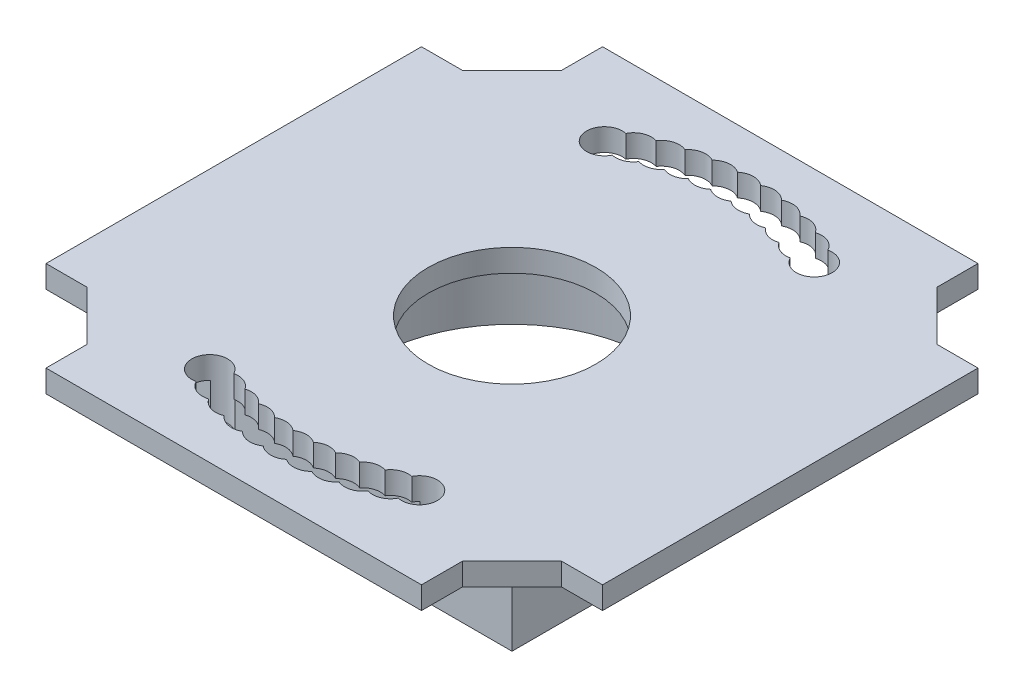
ISO-10303-21;
HEADER;
FILE_DESCRIPTION(('STEP AP214'),'2;1');
FILE_NAME('part.step','',(''),(''),'','','');
FILE_SCHEMA(('AUTOMOTIVE_DESIGN { 1 0 10303 214 1 1 1 1 }'));
ENDSEC;
DATA;
#1=APPLICATION_CONTEXT('core data for automotive mechanical design processes');
#2=APPLICATION_PROTOCOL_DEFINITION('international standard','automotive_design',2000,#1);
#3=PRODUCT_CONTEXT('',#1,'mechanical');
#4=PRODUCT('Part','Part','',(#3));
#5=PRODUCT_RELATED_PRODUCT_CATEGORY('part','',(#4));
#6=PRODUCT_DEFINITION_FORMATION('','',#4);
#7=PRODUCT_DEFINITION_CONTEXT('part definition',#1,'design');
#8=PRODUCT_DEFINITION('design','',#6,#7);
#9=PRODUCT_DEFINITION_SHAPE('','',#8);
#10=(LENGTH_UNIT() NAMED_UNIT(*) SI_UNIT(.MILLI.,.METRE.));
#11=(NAMED_UNIT(*) PLANE_ANGLE_UNIT() SI_UNIT($,.RADIAN.));
#12=(NAMED_UNIT(*) SI_UNIT($,.STERADIAN.) SOLID_ANGLE_UNIT());
#13=UNCERTAINTY_MEASURE_WITH_UNIT(LENGTH_MEASURE(1.E-05),#10,'distance_accuracy_value','');
#14=(GEOMETRIC_REPRESENTATION_CONTEXT(3) GLOBAL_UNCERTAINTY_ASSIGNED_CONTEXT((#13)) GLOBAL_UNIT_ASSIGNED_CONTEXT((#10,
#11,#12)) REPRESENTATION_CONTEXT('',''));
#15=CARTESIAN_POINT('',(0.,0.,0.));
#16=DIRECTION('',(0.,0.,1.));
#17=DIRECTION('',(1.,0.,0.));
#18=AXIS2_PLACEMENT_3D('',#15,#16,#17);
#19=CARTESIAN_POINT('',(0.,0.,0.));
#20=DIRECTION('',(0.,1.,0.));
#21=DIRECTION('',(0.,0.,1.));
#22=AXIS2_PLACEMENT_3D('',#19,#20,#21);
#23=PLANE('',#22);
#24=CARTESIAN_POINT('',(-3.88287979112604,0.,19.6194608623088));
#25=DIRECTION('',(0.,1.,0.));
#26=DIRECTION('',(0.,0.,1.));
#27=AXIS2_PLACEMENT_3D('',#24,#25,#26);
#28=CIRCLE('',#27,1.6);
#29=CARTESIAN_POINT('',(-5.13691253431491,0.,20.613141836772));
#30=VERTEX_POINT('',#29);
#31=CARTESIAN_POINT('',(-3.10187389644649,0.,21.0158955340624));
#32=VERTEX_POINT('',#31);
#33=EDGE_CURVE('E1205',#30,#32,#28,.T.);
#34=ORIENTED_EDGE('',*,*,#33,.F.);
#35=CARTESIAN_POINT('',(-5.77799037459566,0.,19.1471884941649));
#36=DIRECTION('',(0.,1.,0.));
#37=DIRECTION('',(0.,0.,1.));
#38=AXIS2_PLACEMENT_3D('',#35,#36,#37);
#39=CIRCLE('',#38,1.6);
#40=CARTESIAN_POINT('',(-7.12296447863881,0.,20.0138168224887));
#41=VERTEX_POINT('',#40);
#42=EDGE_CURVE('E1209',#41,#30,#39,.T.);
#43=ORIENTED_EDGE('',*,*,#42,.F.);
#44=CARTESIAN_POINT('',(-7.6180008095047,0.,18.4923244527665));
#45=DIRECTION('',(0.,1.,0.));
#46=DIRECTION('',(0.,0.,1.));
#47=AXIS2_PLACEMENT_3D('',#44,#45,#46);
#48=CIRCLE('',#47,1.6);
#49=CARTESIAN_POINT('',(-9.04109031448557,0.,19.2236357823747));
#50=VERTEX_POINT('',#49);
#51=EDGE_CURVE('E1212',#50,#41,#48,.T.);
#52=ORIENTED_EDGE('',*,*,#51,.F.);
#53=CARTESIAN_POINT('',(-9.38536436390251,0.,17.6611136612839));
#54=DIRECTION('',(0.,1.,0.));
#55=DIRECTION('',(0.,0.,1.));
#56=AXIS2_PLACEMENT_3D('',#53,#54,#55);
#57=CIRCLE('',#56,1.6);
#58=CARTESIAN_POINT('',(-7.96227485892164,0.,16.9298023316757));
#59=VERTEX_POINT('',#58);
#60=EDGE_CURVE('E769',#59,#50,#57,.T.);
#61=ORIENTED_EDGE('',*,*,#60,.F.);
#62=CARTESIAN_POINT('',(-7.6180008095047,0.,18.4923244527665));
#63=DIRECTION('',(0.,1.,0.));
#64=DIRECTION('',(0.,0.,1.));
#65=AXIS2_PLACEMENT_3D('',#62,#63,#64);
#66=CIRCLE('',#65,1.6);
#67=CARTESIAN_POINT('',(-6.27302670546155,0.,17.6256961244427));
#68=VERTEX_POINT('',#67);
#69=EDGE_CURVE('E1157',#68,#59,#66,.T.);
#70=ORIENTED_EDGE('',*,*,#69,.F.);
#71=CARTESIAN_POINT('',(-5.77799037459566,0.,19.1471884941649));
#72=DIRECTION('',(0.,1.,0.));
#73=DIRECTION('',(0.,0.,1.));
#74=AXIS2_PLACEMENT_3D('',#71,#72,#73);
#75=CIRCLE('',#74,1.6);
#76=CARTESIAN_POINT('',(-4.52395763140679,0.,18.1535075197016));
#77=VERTEX_POINT('',#76);
#78=EDGE_CURVE('E1207',#77,#68,#75,.T.);
#79=ORIENTED_EDGE('',*,*,#78,.F.);
#80=CARTESIAN_POINT('',(-3.88287979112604,0.,19.6194608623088));
#81=DIRECTION('',(0.,1.,0.));
#82=DIRECTION('',(0.,0.,1.));
#83=AXIS2_PLACEMENT_3D('',#80,#81,#82);
#84=CIRCLE('',#83,1.6);
#85=CARTESIAN_POINT('',(-2.73174713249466,0.,18.5082031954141));
#86=VERTEX_POINT('',#85);
#87=EDGE_CURVE('E1203',#86,#77,#84,.T.);
#88=ORIENTED_EDGE('',*,*,#87,.F.);
#89=CARTESIAN_POINT('',(-1.95074123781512,0.,19.9046378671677));
#90=DIRECTION('',(0.,1.,0.));
#91=DIRECTION('',(0.,0.,1.));
#92=AXIS2_PLACEMENT_3D('',#89,#90,#91);
#93=CIRCLE('',#92,1.6);
#94=CARTESIAN_POINT('',(-0.91348611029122,0.,18.6864006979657));
#95=VERTEX_POINT('',#94);
#96=EDGE_CURVE('E1201',#95,#86,#93,.T.);
#97=ORIENTED_EDGE('',*,*,#96,.F.);
#98=CARTESIAN_POINT('',(0.,0.,20.));
#99=DIRECTION('',(0.,1.,0.));
#100=DIRECTION('',(0.,0.,1.));
#101=AXIS2_PLACEMENT_3D('',#98,#99,#100);
#102=CIRCLE('',#101,1.6);
#103=CARTESIAN_POINT('',(0.913486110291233,0.,18.6864006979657));
#104=VERTEX_POINT('',#103);
#105=EDGE_CURVE('E766',#95,#104,#102,.F.);
#106=ORIENTED_EDGE('',*,*,#105,.T.);
#107=CARTESIAN_POINT('',(1.95074123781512,0.,19.9046378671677));
#108=DIRECTION('',(0.,1.,0.));
#109=DIRECTION('',(0.,0.,1.));
#110=AXIS2_PLACEMENT_3D('',#107,#108,#109);
#111=CIRCLE('',#110,1.6);
#112=CARTESIAN_POINT('',(2.73174713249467,0.,18.5082031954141));
#113=VERTEX_POINT('',#112);
#114=EDGE_CURVE('E763',#113,#104,#111,.T.);
#115=ORIENTED_EDGE('',*,*,#114,.F.);
#116=CARTESIAN_POINT('',(3.88287979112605,0.,19.6194608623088));
#117=DIRECTION('',(0.,1.,0.));
#118=DIRECTION('',(0.,0.,1.));
#119=AXIS2_PLACEMENT_3D('',#116,#117,#118);
#120=CIRCLE('',#119,1.6);
#121=CARTESIAN_POINT('',(4.5239576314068,0.,18.1535075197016));
#122=VERTEX_POINT('',#121);
#123=EDGE_CURVE('E752',#113,#122,#120,.F.);
#124=ORIENTED_EDGE('',*,*,#123,.T.);
#125=CARTESIAN_POINT('',(5.77799037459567,0.,19.1471884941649));
#126=DIRECTION('',(0.,1.,0.));
#127=DIRECTION('',(0.,0.,1.));
#128=AXIS2_PLACEMENT_3D('',#125,#126,#127);
#129=CIRCLE('',#128,1.6);
#130=CARTESIAN_POINT('',(6.27302670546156,0.,17.6256961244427));
#131=VERTEX_POINT('',#130);
#132=EDGE_CURVE('E739',#131,#122,#129,.T.);
#133=ORIENTED_EDGE('',*,*,#132,.F.);
#134=CARTESIAN_POINT('',(7.61800080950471,0.,18.4923244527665));
#135=DIRECTION('',(0.,1.,0.));
#136=DIRECTION('',(0.,0.,1.));
#137=AXIS2_PLACEMENT_3D('',#134,#135,#136);
#138=CIRCLE('',#137,1.6);
#139=CARTESIAN_POINT('',(7.96227485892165,0.,16.9298023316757));
#140=VERTEX_POINT('',#139);
#141=EDGE_CURVE('E1192',#140,#131,#138,.T.);
#142=ORIENTED_EDGE('',*,*,#141,.F.);
#143=CARTESIAN_POINT('',(9.38536436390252,0.,17.6611136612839));
#144=DIRECTION('',(0.,1.,0.));
#145=DIRECTION('',(0.,0.,1.));
#146=AXIS2_PLACEMENT_3D('',#143,#144,#145);
#147=CIRCLE('',#146,1.6);
#148=CARTESIAN_POINT('',(9.04109031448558,0.,19.2236357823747));
#149=VERTEX_POINT('',#148);
#150=EDGE_CURVE('E1197',#149,#140,#147,.T.);
#151=ORIENTED_EDGE('',*,*,#150,.F.);
#152=CARTESIAN_POINT('',(7.61800080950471,0.,18.4923244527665));
#153=DIRECTION('',(0.,1.,0.));
#154=DIRECTION('',(0.,0.,1.));
#155=AXIS2_PLACEMENT_3D('',#152,#153,#154);
#156=CIRCLE('',#155,1.6);
#157=CARTESIAN_POINT('',(7.12296447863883,0.,20.0138168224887));
#158=VERTEX_POINT('',#157);
#159=EDGE_CURVE('E1190',#158,#149,#156,.T.);
#160=ORIENTED_EDGE('',*,*,#159,.F.);
#161=CARTESIAN_POINT('',(5.77799037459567,0.,19.1471884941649));
#162=DIRECTION('',(0.,1.,0.));
#163=DIRECTION('',(0.,0.,1.));
#164=AXIS2_PLACEMENT_3D('',#161,#162,#163);
#165=CIRCLE('',#164,1.6);
#166=CARTESIAN_POINT('',(5.13691253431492,0.,20.613141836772));
#167=VERTEX_POINT('',#166);
#168=EDGE_CURVE('E747',#167,#158,#165,.T.);
#169=ORIENTED_EDGE('',*,*,#168,.F.);
#170=CARTESIAN_POINT('',(3.88287979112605,0.,19.6194608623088));
#171=DIRECTION('',(0.,1.,0.));
#172=DIRECTION('',(0.,0.,1.));
#173=AXIS2_PLACEMENT_3D('',#170,#171,#172);
#174=CIRCLE('',#173,1.6);
#175=CARTESIAN_POINT('',(3.1018738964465,0.,21.0158955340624));
#176=VERTEX_POINT('',#175);
#177=EDGE_CURVE('E764',#167,#176,#174,.F.);
#178=ORIENTED_EDGE('',*,*,#177,.T.);
#179=CARTESIAN_POINT('',(1.95074123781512,0.,19.9046378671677));
#180=DIRECTION('',(0.,1.,0.));
#181=DIRECTION('',(0.,0.,1.));
#182=AXIS2_PLACEMENT_3D('',#179,#180,#181);
#183=CIRCLE('',#182,1.6);
#184=CARTESIAN_POINT('',(1.0372551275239,0.,21.218237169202));
#185=VERTEX_POINT('',#184);
#186=EDGE_CURVE('E777',#185,#176,#183,.T.);
#187=ORIENTED_EDGE('',*,*,#186,.F.);
#188=CARTESIAN_POINT('',(0.,0.,20.));
#189=DIRECTION('',(0.,1.,0.));
#190=DIRECTION('',(0.,0.,1.));
#191=AXIS2_PLACEMENT_3D('',#188,#189,#190);
#192=CIRCLE('',#191,1.6);
#193=CARTESIAN_POINT('',(-1.03725512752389,0.,21.218237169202));
#194=VERTEX_POINT('',#193);
#195=EDGE_CURVE('E774',#185,#194,#192,.F.);
#196=ORIENTED_EDGE('',*,*,#195,.T.);
#197=CARTESIAN_POINT('',(-1.95074123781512,0.,19.9046378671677));
#198=DIRECTION('',(0.,1.,0.));
#199=DIRECTION('',(0.,0.,1.));
#200=AXIS2_PLACEMENT_3D('',#197,#198,#199);
#201=CIRCLE('',#200,1.6);
#202=EDGE_CURVE('E1199',#32,#194,#201,.T.);
#203=ORIENTED_EDGE('',*,*,#202,.F.);
#204=EDGE_LOOP('',(#34,#43,#52,#61,#70,#79,#88,#97,#106,#115,#124,#133,#142,#151,#160,#169,#178,
#187,#196,#203));
#205=FACE_BOUND('',#204,.T.);
#206=DIRECTION('',(0.707106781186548,0.,0.707106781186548));
#207=VECTOR('',#206,1.);
#208=CARTESIAN_POINT('',(-19.0196847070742,0.,19.0196847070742));
#209=LINE('',#208,#207);
#210=CARTESIAN_POINT('',(-21.24,0.,16.7993694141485));
#211=VERTEX_POINT('',#210);
#212=CARTESIAN_POINT('',(-16.7993694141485,0.,21.24));
#213=VERTEX_POINT('',#212);
#214=EDGE_CURVE('E922',#211,#213,#209,.T.);
#215=ORIENTED_EDGE('',*,*,#214,.T.);
#216=DIRECTION('',(0.,0.,1.));
#217=VECTOR('',#216,1.);
#218=CARTESIAN_POINT('',(-16.7993694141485,0.,0.));
#219=LINE('',#218,#217);
#220=CARTESIAN_POINT('',(-16.7993694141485,0.,24.9));
#221=VERTEX_POINT('',#220);
#222=EDGE_CURVE('E925',#213,#221,#219,.T.);
#223=ORIENTED_EDGE('',*,*,#222,.T.);
#224=DIRECTION('',(1.,0.,0.));
#225=VECTOR('',#224,1.);
#226=CARTESIAN_POINT('',(0.,0.,24.9));
#227=LINE('',#226,#225);
#228=CARTESIAN_POINT('',(16.7993694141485,0.,24.9));
#229=VERTEX_POINT('',#228);
#230=EDGE_CURVE('E928',#221,#229,#227,.T.);
#231=ORIENTED_EDGE('',*,*,#230,.T.);
#232=DIRECTION('',(0.,0.,-1.));
#233=VECTOR('',#232,1.);
#234=CARTESIAN_POINT('',(16.7993694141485,0.,0.));
#235=LINE('',#234,#233);
#236=CARTESIAN_POINT('',(16.7993694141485,0.,21.24));
#237=VERTEX_POINT('',#236);
#238=EDGE_CURVE('E931',#229,#237,#235,.T.);
#239=ORIENTED_EDGE('',*,*,#238,.T.);
#240=DIRECTION('',(0.707106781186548,0.,-0.707106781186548));
#241=VECTOR('',#240,1.);
#242=CARTESIAN_POINT('',(19.0196847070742,0.,19.0196847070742));
#243=LINE('',#242,#241);
#244=CARTESIAN_POINT('',(21.24,0.,16.7993694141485));
#245=VERTEX_POINT('',#244);
#246=EDGE_CURVE('E934',#237,#245,#243,.T.);
#247=ORIENTED_EDGE('',*,*,#246,.T.);
#248=DIRECTION('',(1.,0.,0.));
#249=VECTOR('',#248,1.);
#250=CARTESIAN_POINT('',(0.,0.,16.7993694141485));
#251=LINE('',#250,#249);
#252=CARTESIAN_POINT('',(24.9,0.,16.7993694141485));
#253=VERTEX_POINT('',#252);
#254=EDGE_CURVE('E937',#245,#253,#251,.T.);
#255=ORIENTED_EDGE('',*,*,#254,.T.);
#256=DIRECTION('',(0.,0.,-1.));
#257=VECTOR('',#256,1.);
#258=CARTESIAN_POINT('',(24.9,0.,0.));
#259=LINE('',#258,#257);
#260=CARTESIAN_POINT('',(24.9,0.,-16.7993694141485));
#261=VERTEX_POINT('',#260);
#262=EDGE_CURVE('E940',#253,#261,#259,.T.);
#263=ORIENTED_EDGE('',*,*,#262,.T.);
#264=DIRECTION('',(-1.,0.,0.));
#265=VECTOR('',#264,1.);
#266=CARTESIAN_POINT('',(0.,0.,-16.7993694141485));
#267=LINE('',#266,#265);
#268=CARTESIAN_POINT('',(21.24,0.,-16.7993694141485));
#269=VERTEX_POINT('',#268);
#270=EDGE_CURVE('E943',#261,#269,#267,.T.);
#271=ORIENTED_EDGE('',*,*,#270,.T.);
#272=DIRECTION('',(-0.707106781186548,0.,-0.707106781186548));
#273=VECTOR('',#272,1.);
#274=CARTESIAN_POINT('',(19.0196847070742,0.,-19.0196847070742));
#275=LINE('',#274,#273);
#276=CARTESIAN_POINT('',(16.7993694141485,0.,-21.24));
#277=VERTEX_POINT('',#276);
#278=EDGE_CURVE('E946',#269,#277,#275,.T.);
#279=ORIENTED_EDGE('',*,*,#278,.T.);
#280=DIRECTION('',(0.,0.,-1.));
#281=VECTOR('',#280,1.);
#282=CARTESIAN_POINT('',(16.7993694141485,0.,0.));
#283=LINE('',#282,#281);
#284=CARTESIAN_POINT('',(16.7993694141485,0.,-24.9));
#285=VERTEX_POINT('',#284);
#286=EDGE_CURVE('E949',#277,#285,#283,.T.);
#287=ORIENTED_EDGE('',*,*,#286,.T.);
#288=DIRECTION('',(1.,0.,0.));
#289=VECTOR('',#288,1.);
#290=CARTESIAN_POINT('',(0.,0.,-24.9));
#291=LINE('',#290,#289);
#292=CARTESIAN_POINT('',(-16.7993694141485,0.,-24.9));
#293=VERTEX_POINT('',#292);
#294=EDGE_CURVE('E952',#293,#285,#291,.T.);
#295=ORIENTED_EDGE('',*,*,#294,.F.);
#296=DIRECTION('',(0.,0.,1.));
#297=VECTOR('',#296,1.);
#298=CARTESIAN_POINT('',(-16.7993694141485,0.,0.));
#299=LINE('',#298,#297);
#300=CARTESIAN_POINT('',(-16.7993694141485,0.,-21.24));
#301=VERTEX_POINT('',#300);
#302=EDGE_CURVE('E955',#293,#301,#299,.T.);
#303=ORIENTED_EDGE('',*,*,#302,.T.);
#304=DIRECTION('',(-0.707106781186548,0.,0.707106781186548));
#305=VECTOR('',#304,1.);
#306=CARTESIAN_POINT('',(-19.0196847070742,0.,-19.0196847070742));
#307=LINE('',#306,#305);
#308=CARTESIAN_POINT('',(-21.24,0.,-16.7993694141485));
#309=VERTEX_POINT('',#308);
#310=EDGE_CURVE('E958',#301,#309,#307,.T.);
#311=ORIENTED_EDGE('',*,*,#310,.T.);
#312=DIRECTION('',(-1.,0.,0.));
#313=VECTOR('',#312,1.);
#314=CARTESIAN_POINT('',(0.,0.,-16.7993694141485));
#315=LINE('',#314,#313);
#316=CARTESIAN_POINT('',(-24.9,0.,-16.7993694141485));
#317=VERTEX_POINT('',#316);
#318=EDGE_CURVE('E961',#309,#317,#315,.T.);
#319=ORIENTED_EDGE('',*,*,#318,.T.);
#320=DIRECTION('',(0.,0.,-1.));
#321=VECTOR('',#320,1.);
#322=CARTESIAN_POINT('',(-24.9,0.,0.));
#323=LINE('',#322,#321);
#324=CARTESIAN_POINT('',(-24.9,0.,16.7993694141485));
#325=VERTEX_POINT('',#324);
#326=EDGE_CURVE('E964',#325,#317,#323,.T.);
#327=ORIENTED_EDGE('',*,*,#326,.F.);
#328=DIRECTION('',(1.,0.,0.));
#329=VECTOR('',#328,1.);
#330=CARTESIAN_POINT('',(0.,0.,16.7993694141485));
#331=LINE('',#330,#329);
#332=EDGE_CURVE('E967',#325,#211,#331,.T.);
#333=ORIENTED_EDGE('',*,*,#332,.T.);
#334=EDGE_LOOP('',(#215,#223,#231,#239,#247,#255,#263,#271,#279,#287,#295,#303,#311,#319,#327,#333));
#335=FACE_BOUND('',#334,.T.);
#336=CARTESIAN_POINT('',(0.,0.,0.));
#337=DIRECTION('',(0.,1.,0.));
#338=DIRECTION('',(0.,0.,1.));
#339=AXIS2_PLACEMENT_3D('',#336,#337,#338);
#340=CIRCLE('',#339,7.5);
#341=CARTESIAN_POINT('',(0.,0.,7.50000000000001));
#342=VERTEX_POINT('',#341);
#343=EDGE_CURVE('E970',#342,#342,#340,.T.);
#344=ORIENTED_EDGE('',*,*,#343,.F.);
#345=EDGE_LOOP('',(#344));
#346=FACE_BOUND('',#345,.T.);
#347=CARTESIAN_POINT('',(-9.38536436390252,0.,-17.6611136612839));
#348=DIRECTION('',(0.,1.,0.));
#349=DIRECTION('',(0.,0.,1.));
#350=AXIS2_PLACEMENT_3D('',#347,#348,#349);
#351=CIRCLE('',#350,1.6);
#352=CARTESIAN_POINT('',(-9.04109031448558,0.,-19.2236357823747));
#353=VERTEX_POINT('',#352);
#354=CARTESIAN_POINT('',(-7.96227485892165,0.,-16.9298023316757));
#355=VERTEX_POINT('',#354);
#356=EDGE_CURVE('E840',#353,#355,#351,.T.);
#357=ORIENTED_EDGE('',*,*,#356,.F.);
#358=CARTESIAN_POINT('',(-7.61800080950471,0.,-18.4923244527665));
#359=DIRECTION('',(0.,1.,0.));
#360=DIRECTION('',(0.,0.,1.));
#361=AXIS2_PLACEMENT_3D('',#358,#359,#360);
#362=CIRCLE('',#361,1.6);
#363=CARTESIAN_POINT('',(-7.12296447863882,0.,-20.0138168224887));
#364=VERTEX_POINT('',#363);
#365=EDGE_CURVE('E833',#353,#364,#362,.F.);
#366=ORIENTED_EDGE('',*,*,#365,.T.);
#367=CARTESIAN_POINT('',(-5.77799037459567,0.,-19.1471884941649));
#368=DIRECTION('',(0.,1.,0.));
#369=DIRECTION('',(0.,0.,1.));
#370=AXIS2_PLACEMENT_3D('',#367,#368,#369);
#371=CIRCLE('',#370,1.6);
#372=CARTESIAN_POINT('',(-5.13691253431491,0.,-20.613141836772));
#373=VERTEX_POINT('',#372);
#374=EDGE_CURVE('E827',#364,#373,#371,.F.);
#375=ORIENTED_EDGE('',*,*,#374,.T.);
#376=CARTESIAN_POINT('',(-3.88287979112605,0.,-19.6194608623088));
#377=DIRECTION('',(0.,1.,0.));
#378=DIRECTION('',(0.,0.,1.));
#379=AXIS2_PLACEMENT_3D('',#376,#377,#378);
#380=CIRCLE('',#379,1.6);
#381=CARTESIAN_POINT('',(-3.1018738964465,0.,-21.0158955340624));
#382=VERTEX_POINT('',#381);
#383=EDGE_CURVE('E821',#373,#382,#380,.F.);
#384=ORIENTED_EDGE('',*,*,#383,.T.);
#385=CARTESIAN_POINT('',(-1.95074123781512,0.,-19.9046378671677));
#386=DIRECTION('',(0.,1.,0.));
#387=DIRECTION('',(0.,0.,1.));
#388=AXIS2_PLACEMENT_3D('',#385,#386,#387);
#389=CIRCLE('',#388,1.6);
#390=CARTESIAN_POINT('',(-1.0372551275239,0.,-21.218237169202));
#391=VERTEX_POINT('',#390);
#392=EDGE_CURVE('E815',#382,#391,#389,.F.);
#393=ORIENTED_EDGE('',*,*,#392,.T.);
#394=CARTESIAN_POINT('',(0.,0.,-20.));
#395=DIRECTION('',(0.,1.,0.));
#396=DIRECTION('',(0.,0.,1.));
#397=AXIS2_PLACEMENT_3D('',#394,#395,#396);
#398=CIRCLE('',#397,1.6);
#399=CARTESIAN_POINT('',(1.0372551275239,0.,-21.218237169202));
#400=VERTEX_POINT('',#399);
#401=EDGE_CURVE('E809',#391,#400,#398,.F.);
#402=ORIENTED_EDGE('',*,*,#401,.T.);
#403=CARTESIAN_POINT('',(1.95074123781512,0.,-19.9046378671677));
#404=DIRECTION('',(0.,1.,0.));
#405=DIRECTION('',(0.,0.,1.));
#406=AXIS2_PLACEMENT_3D('',#403,#404,#405);
#407=CIRCLE('',#406,1.6);
#408=CARTESIAN_POINT('',(3.1018738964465,0.,-21.0158955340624));
#409=VERTEX_POINT('',#408);
#410=EDGE_CURVE('E803',#400,#409,#407,.F.);
#411=ORIENTED_EDGE('',*,*,#410,.T.);
#412=CARTESIAN_POINT('',(3.88287979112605,0.,-19.6194608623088));
#413=DIRECTION('',(0.,1.,0.));
#414=DIRECTION('',(0.,0.,1.));
#415=AXIS2_PLACEMENT_3D('',#412,#413,#414);
#416=CIRCLE('',#415,1.6);
#417=CARTESIAN_POINT('',(5.13691253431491,0.,-20.613141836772));
#418=VERTEX_POINT('',#417);
#419=EDGE_CURVE('E794',#409,#418,#416,.F.);
#420=ORIENTED_EDGE('',*,*,#419,.T.);
#421=CARTESIAN_POINT('',(5.77799037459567,0.,-19.1471884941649));
#422=DIRECTION('',(0.,1.,0.));
#423=DIRECTION('',(0.,0.,1.));
#424=AXIS2_PLACEMENT_3D('',#421,#422,#423);
#425=CIRCLE('',#424,1.6);
#426=CARTESIAN_POINT('',(7.12296447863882,0.,-20.0138168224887));
#427=VERTEX_POINT('',#426);
#428=EDGE_CURVE('E842',#418,#427,#425,.F.);
#429=ORIENTED_EDGE('',*,*,#428,.T.);
#430=CARTESIAN_POINT('',(7.61800080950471,0.,-18.4923244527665));
#431=DIRECTION('',(0.,1.,0.));
#432=DIRECTION('',(0.,0.,1.));
#433=AXIS2_PLACEMENT_3D('',#430,#431,#432);
#434=CIRCLE('',#433,1.6);
#435=CARTESIAN_POINT('',(9.04109031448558,0.,-19.2236357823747));
#436=VERTEX_POINT('',#435);
#437=EDGE_CURVE('E782',#427,#436,#434,.F.);
#438=ORIENTED_EDGE('',*,*,#437,.T.);
#439=CARTESIAN_POINT('',(9.38536436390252,0.,-17.6611136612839));
#440=DIRECTION('',(0.,1.,0.));
#441=DIRECTION('',(0.,0.,1.));
#442=AXIS2_PLACEMENT_3D('',#439,#440,#441);
#443=CIRCLE('',#442,1.6);
#444=CARTESIAN_POINT('',(7.96227485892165,0.,-16.9298023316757));
#445=VERTEX_POINT('',#444);
#446=EDGE_CURVE('E791',#436,#445,#443,.F.);
#447=ORIENTED_EDGE('',*,*,#446,.T.);
#448=CARTESIAN_POINT('',(7.61800080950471,0.,-18.4923244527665));
#449=DIRECTION('',(0.,1.,0.));
#450=DIRECTION('',(0.,0.,1.));
#451=AXIS2_PLACEMENT_3D('',#448,#449,#450);
#452=CIRCLE('',#451,1.6);
#453=CARTESIAN_POINT('',(6.27302670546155,0.,-17.6256961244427));
#454=VERTEX_POINT('',#453);
#455=EDGE_CURVE('E779',#445,#454,#452,.F.);
#456=ORIENTED_EDGE('',*,*,#455,.T.);
#457=CARTESIAN_POINT('',(5.77799037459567,0.,-19.1471884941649));
#458=DIRECTION('',(0.,1.,0.));
#459=DIRECTION('',(0.,0.,1.));
#460=AXIS2_PLACEMENT_3D('',#457,#458,#459);
#461=CIRCLE('',#460,1.6);
#462=CARTESIAN_POINT('',(4.5239576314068,0.,-18.1535075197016));
#463=VERTEX_POINT('',#462);
#464=EDGE_CURVE('E845',#454,#463,#461,.F.);
#465=ORIENTED_EDGE('',*,*,#464,.T.);
#466=CARTESIAN_POINT('',(3.88287979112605,0.,-19.6194608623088));
#467=DIRECTION('',(0.,1.,0.));
#468=DIRECTION('',(0.,0.,1.));
#469=AXIS2_PLACEMENT_3D('',#466,#467,#468);
#470=CIRCLE('',#469,1.6);
#471=CARTESIAN_POINT('',(2.73174713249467,0.,-18.5082031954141));
#472=VERTEX_POINT('',#471);
#473=EDGE_CURVE('E797',#463,#472,#470,.F.);
#474=ORIENTED_EDGE('',*,*,#473,.T.);
#475=CARTESIAN_POINT('',(1.95074123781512,0.,-19.9046378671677));
#476=DIRECTION('',(0.,1.,0.));
#477=DIRECTION('',(0.,0.,1.));
#478=AXIS2_PLACEMENT_3D('',#475,#476,#477);
#479=CIRCLE('',#478,1.6);
#480=CARTESIAN_POINT('',(0.913486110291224,0.,-18.6864006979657));
#481=VERTEX_POINT('',#480);
#482=EDGE_CURVE('E800',#472,#481,#479,.F.);
#483=ORIENTED_EDGE('',*,*,#482,.T.);
#484=CARTESIAN_POINT('',(0.,0.,-20.));
#485=DIRECTION('',(0.,1.,0.));
#486=DIRECTION('',(0.,0.,1.));
#487=AXIS2_PLACEMENT_3D('',#484,#485,#486);
#488=CIRCLE('',#487,1.6);
#489=CARTESIAN_POINT('',(-0.913486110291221,0.,-18.6864006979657));
#490=VERTEX_POINT('',#489);
#491=EDGE_CURVE('E806',#481,#490,#488,.F.);
#492=ORIENTED_EDGE('',*,*,#491,.T.);
#493=CARTESIAN_POINT('',(-1.95074123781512,0.,-19.9046378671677));
#494=DIRECTION('',(0.,1.,0.));
#495=DIRECTION('',(0.,0.,1.));
#496=AXIS2_PLACEMENT_3D('',#493,#494,#495);
#497=CIRCLE('',#496,1.6);
#498=CARTESIAN_POINT('',(-2.73174713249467,0.,-18.5082031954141));
#499=VERTEX_POINT('',#498);
#500=EDGE_CURVE('E812',#490,#499,#497,.F.);
#501=ORIENTED_EDGE('',*,*,#500,.T.);
#502=CARTESIAN_POINT('',(-3.88287979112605,0.,-19.6194608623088));
#503=DIRECTION('',(0.,1.,0.));
#504=DIRECTION('',(0.,0.,1.));
#505=AXIS2_PLACEMENT_3D('',#502,#503,#504);
#506=CIRCLE('',#505,1.6);
#507=CARTESIAN_POINT('',(-4.5239576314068,0.,-18.1535075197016));
#508=VERTEX_POINT('',#507);
#509=EDGE_CURVE('E818',#499,#508,#506,.F.);
#510=ORIENTED_EDGE('',*,*,#509,.T.);
#511=CARTESIAN_POINT('',(-5.77799037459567,0.,-19.1471884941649));
#512=DIRECTION('',(0.,1.,0.));
#513=DIRECTION('',(0.,0.,1.));
#514=AXIS2_PLACEMENT_3D('',#511,#512,#513);
#515=CIRCLE('',#514,1.6);
#516=CARTESIAN_POINT('',(-6.27302670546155,0.,-17.6256961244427));
#517=VERTEX_POINT('',#516);
#518=EDGE_CURVE('E824',#508,#517,#515,.F.);
#519=ORIENTED_EDGE('',*,*,#518,.T.);
#520=CARTESIAN_POINT('',(-7.61800080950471,0.,-18.4923244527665));
#521=DIRECTION('',(0.,1.,0.));
#522=DIRECTION('',(0.,0.,1.));
#523=AXIS2_PLACEMENT_3D('',#520,#521,#522);
#524=CIRCLE('',#523,1.6);
#525=EDGE_CURVE('E830',#517,#355,#524,.F.);
#526=ORIENTED_EDGE('',*,*,#525,.T.);
#527=EDGE_LOOP('',(#357,#366,#375,#384,#393,#402,#411,#420,#429,#438,#447,#456,#465,#474,#483,
#492,#501,#510,#519,#526));
#528=FACE_BOUND('',#527,.T.);
#529=ADVANCED_FACE('F316',(#205,#335,#346,#528),#23,.T.);
#530=CARTESIAN_POINT('',(-16.5,70.4278354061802,-16.5));
#531=DIRECTION('',(0.,0.,-1.));
#532=DIRECTION('',(-1.,0.,0.));
#533=AXIS2_PLACEMENT_3D('',#530,#531,#532);
#534=PLANE('',#533);
#535=DIRECTION('',(0.,-1.,0.));
#536=VECTOR('',#535,1.);
#537=CARTESIAN_POINT('',(-8.284539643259,1.2E-05,-16.5));
#538=LINE('',#537,#536);
#539=CARTESIAN_POINT('',(-8.284539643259,-2.,-16.5));
#540=VERTEX_POINT('',#539);
#541=CARTESIAN_POINT('',(-8.284539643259,-5.,-16.5));
#542=VERTEX_POINT('',#541);
#543=EDGE_CURVE('E836',#540,#542,#538,.T.);
#544=ORIENTED_EDGE('',*,*,#543,.F.);
#545=DIRECTION('',(1.,0.,0.));
#546=VECTOR('',#545,1.);
#547=CARTESIAN_POINT('',(-16.5,-2.,-16.5));
#548=LINE('',#547,#546);
#549=CARTESIAN_POINT('',(8.284539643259,-2.,-16.5));
#550=VERTEX_POINT('',#549);
#551=EDGE_CURVE('E882',#540,#550,#548,.T.);
#552=ORIENTED_EDGE('',*,*,#551,.T.);
#553=DIRECTION('',(0.,-1.,0.));
#554=VECTOR('',#553,1.);
#555=CARTESIAN_POINT('',(8.284539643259,1.2E-05,-16.5));
#556=LINE('',#555,#554);
#557=CARTESIAN_POINT('',(8.284539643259,-5.,-16.5));
#558=VERTEX_POINT('',#557);
#559=EDGE_CURVE('E785',#550,#558,#556,.T.);
#560=ORIENTED_EDGE('',*,*,#559,.T.);
#561=DIRECTION('',(1.,0.,0.));
#562=VECTOR('',#561,1.);
#563=CARTESIAN_POINT('',(-16.5,-5.,-16.5));
#564=LINE('',#563,#562);
#565=CARTESIAN_POINT('',(10.486189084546,-5.,-16.5));
#566=VERTEX_POINT('',#565);
#567=EDGE_CURVE('E320',#558,#566,#564,.T.);
#568=ORIENTED_EDGE('',*,*,#567,.T.);
#569=DIRECTION('',(0.,-1.,0.));
#570=VECTOR('',#569,1.);
#571=CARTESIAN_POINT('',(10.486189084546,1.2E-05,-16.5));
#572=LINE('',#571,#570);
#573=CARTESIAN_POINT('',(10.486189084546,-2.,-16.5));
#574=VERTEX_POINT('',#573);
#575=EDGE_CURVE('E788',#566,#574,#572,.F.);
#576=ORIENTED_EDGE('',*,*,#575,.T.);
#577=CARTESIAN_POINT('',(16.5,-2.,-16.5));
#578=VERTEX_POINT('',#577);
#579=EDGE_CURVE('E867',#574,#578,#548,.T.);
#580=ORIENTED_EDGE('',*,*,#579,.T.);
#581=DIRECTION('',(0.,-1.,0.));
#582=VECTOR('',#581,1.);
#583=CARTESIAN_POINT('',(16.5,70.4278354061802,-16.5));
#584=LINE('',#583,#582);
#585=CARTESIAN_POINT('',(16.5,-9.5,-16.5));
#586=VERTEX_POINT('',#585);
#587=EDGE_CURVE('E871',#578,#586,#584,.T.);
#588=ORIENTED_EDGE('',*,*,#587,.T.);
#589=DIRECTION('',(1.,0.,0.));
#590=VECTOR('',#589,1.);
#591=CARTESIAN_POINT('',(-16.5,-9.5,-16.5));
#592=LINE('',#591,#590);
#593=CARTESIAN_POINT('',(-16.5,-9.5,-16.5));
#594=VERTEX_POINT('',#593);
#595=EDGE_CURVE('E855',#594,#586,#592,.T.);
#596=ORIENTED_EDGE('',*,*,#595,.F.);
#597=DIRECTION('',(0.,-1.,0.));
#598=VECTOR('',#597,1.);
#599=CARTESIAN_POINT('',(-16.5,70.4278354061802,-16.5));
#600=LINE('',#599,#598);
#601=CARTESIAN_POINT('',(-16.5,-2.,-16.5));
#602=VERTEX_POINT('',#601);
#603=EDGE_CURVE('E859',#602,#594,#600,.T.);
#604=ORIENTED_EDGE('',*,*,#603,.F.);
#605=CARTESIAN_POINT('',(-10.486189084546,-2.,-16.5));
#606=VERTEX_POINT('',#605);
#607=EDGE_CURVE('E879',#602,#606,#548,.T.);
#608=ORIENTED_EDGE('',*,*,#607,.T.);
#609=DIRECTION('',(0.,-1.,0.));
#610=VECTOR('',#609,1.);
#611=CARTESIAN_POINT('',(-10.486189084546,1.2E-05,-16.5));
#612=LINE('',#611,#610);
#613=CARTESIAN_POINT('',(-10.486189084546,-5.,-16.5));
#614=VERTEX_POINT('',#613);
#615=EDGE_CURVE('E838',#614,#606,#612,.F.);
#616=ORIENTED_EDGE('',*,*,#615,.F.);
#617=EDGE_CURVE('E13',#614,#542,#564,.T.);
#618=ORIENTED_EDGE('',*,*,#617,.T.);
#619=EDGE_LOOP('',(#544,#552,#560,#568,#576,#580,#588,#596,#604,#608,#616,#618));
#620=FACE_BOUND('',#619,.T.);
#621=ADVANCED_FACE('F1129',(#620),#534,.T.);
#622=CARTESIAN_POINT('',(0.,-2.,0.));
#623=DIRECTION('',(0.,1.,0.));
#624=DIRECTION('',(0.,0.,1.));
#625=AXIS2_PLACEMENT_3D('',#622,#623,#624);
#626=PLANE('',#625);
#627=CARTESIAN_POINT('',(-7.61800080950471,-2.,-18.4923244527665));
#628=DIRECTION('',(0.,1.,0.));
#629=DIRECTION('',(0.,0.,1.));
#630=AXIS2_PLACEMENT_3D('',#627,#628,#629);
#631=CIRCLE('',#630,1.6);
#632=CARTESIAN_POINT('',(-9.04109031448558,-2.,-19.2236357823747));
#633=VERTEX_POINT('',#632);
#634=CARTESIAN_POINT('',(-7.12296447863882,-2.,-20.0138168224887));
#635=VERTEX_POINT('',#634);
#636=EDGE_CURVE('E1107',#633,#635,#631,.F.);
#637=ORIENTED_EDGE('',*,*,#636,.F.);
#638=CARTESIAN_POINT('',(-9.38536436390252,-2.,-17.6611136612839));
#639=DIRECTION('',(0.,1.,0.));
#640=DIRECTION('',(0.,0.,1.));
#641=AXIS2_PLACEMENT_3D('',#638,#639,#640);
#642=CIRCLE('',#641,1.6);
#643=EDGE_CURVE('E1091',#633,#606,#642,.T.);
#644=ORIENTED_EDGE('',*,*,#643,.T.);
#645=ORIENTED_EDGE('',*,*,#607,.F.);
#646=DIRECTION('',(0.,0.,-1.));
#647=VECTOR('',#646,1.);
#648=CARTESIAN_POINT('',(-16.5,-2.,-16.5));
#649=LINE('',#648,#647);
#650=CARTESIAN_POINT('',(-16.5,-2.,16.5));
#651=VERTEX_POINT('',#650);
#652=EDGE_CURVE('E883',#651,#602,#649,.T.);
#653=ORIENTED_EDGE('',*,*,#652,.F.);
#654=DIRECTION('',(-1.,0.,0.));
#655=VECTOR('',#654,1.);
#656=CARTESIAN_POINT('',(-16.5,-2.,16.5));
#657=LINE('',#656,#655);
#658=CARTESIAN_POINT('',(-10.486189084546,-2.,16.5));
#659=VERTEX_POINT('',#658);
#660=EDGE_CURVE('E878',#659,#651,#657,.T.);
#661=ORIENTED_EDGE('',*,*,#660,.F.);
#662=CARTESIAN_POINT('',(-9.38536436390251,-2.,17.6611136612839));
#663=DIRECTION('',(0.,1.,0.));
#664=DIRECTION('',(0.,0.,1.));
#665=AXIS2_PLACEMENT_3D('',#662,#663,#664);
#666=CIRCLE('',#665,1.6);
#667=CARTESIAN_POINT('',(-9.04109031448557,-2.,19.2236357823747));
#668=VERTEX_POINT('',#667);
#669=EDGE_CURVE('E1040',#659,#668,#666,.T.);
#670=ORIENTED_EDGE('',*,*,#669,.T.);
#671=CARTESIAN_POINT('',(-7.6180008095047,-2.,18.4923244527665));
#672=DIRECTION('',(0.,1.,0.));
#673=DIRECTION('',(0.,0.,1.));
#674=AXIS2_PLACEMENT_3D('',#671,#672,#673);
#675=CIRCLE('',#674,1.6);
#676=CARTESIAN_POINT('',(-7.12296447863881,-2.,20.0138168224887));
#677=VERTEX_POINT('',#676);
#678=EDGE_CURVE('E1062',#668,#677,#675,.T.);
#679=ORIENTED_EDGE('',*,*,#678,.T.);
#680=CARTESIAN_POINT('',(-5.77799037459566,-2.,19.1471884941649));
#681=DIRECTION('',(0.,1.,0.));
#682=DIRECTION('',(0.,0.,1.));
#683=AXIS2_PLACEMENT_3D('',#680,#681,#682);
#684=CIRCLE('',#683,1.6);
#685=CARTESIAN_POINT('',(-5.13691253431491,-2.,20.613141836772));
#686=VERTEX_POINT('',#685);
#687=EDGE_CURVE('E1059',#677,#686,#684,.T.);
#688=ORIENTED_EDGE('',*,*,#687,.T.);
#689=CARTESIAN_POINT('',(-3.88287979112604,-2.,19.6194608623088));
#690=DIRECTION('',(0.,1.,0.));
#691=DIRECTION('',(0.,0.,1.));
#692=AXIS2_PLACEMENT_3D('',#689,#690,#691);
#693=CIRCLE('',#692,1.6);
#694=CARTESIAN_POINT('',(-3.10187389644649,-2.,21.0158955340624));
#695=VERTEX_POINT('',#694);
#696=EDGE_CURVE('E1056',#686,#695,#693,.T.);
#697=ORIENTED_EDGE('',*,*,#696,.T.);
#698=CARTESIAN_POINT('',(-1.95074123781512,-2.,19.9046378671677));
#699=DIRECTION('',(0.,1.,0.));
#700=DIRECTION('',(0.,0.,1.));
#701=AXIS2_PLACEMENT_3D('',#698,#699,#700);
#702=CIRCLE('',#701,1.6);
#703=CARTESIAN_POINT('',(-1.03725512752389,-2.,21.218237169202));
#704=VERTEX_POINT('',#703);
#705=EDGE_CURVE('E1053',#695,#704,#702,.T.);
#706=ORIENTED_EDGE('',*,*,#705,.T.);
#707=CARTESIAN_POINT('',(0.,-2.,20.));
#708=DIRECTION('',(0.,1.,0.));
#709=DIRECTION('',(0.,0.,1.));
#710=AXIS2_PLACEMENT_3D('',#707,#708,#709);
#711=CIRCLE('',#710,1.6);
#712=CARTESIAN_POINT('',(1.0372551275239,-2.,21.218237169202));
#713=VERTEX_POINT('',#712);
#714=EDGE_CURVE('E1051',#713,#704,#711,.F.);
#715=ORIENTED_EDGE('',*,*,#714,.F.);
#716=CARTESIAN_POINT('',(1.95074123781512,-2.,19.9046378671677));
#717=DIRECTION('',(0.,1.,0.));
#718=DIRECTION('',(0.,0.,1.));
#719=AXIS2_PLACEMENT_3D('',#716,#717,#718);
#720=CIRCLE('',#719,1.6);
#721=CARTESIAN_POINT('',(3.1018738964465,-2.,21.0158955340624));
#722=VERTEX_POINT('',#721);
#723=EDGE_CURVE('E1048',#713,#722,#720,.T.);
#724=ORIENTED_EDGE('',*,*,#723,.T.);
#725=CARTESIAN_POINT('',(3.88287979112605,-2.,19.6194608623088));
#726=DIRECTION('',(0.,1.,0.));
#727=DIRECTION('',(0.,0.,1.));
#728=AXIS2_PLACEMENT_3D('',#725,#726,#727);
#729=CIRCLE('',#728,1.6);
#730=CARTESIAN_POINT('',(5.13691253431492,-2.,20.613141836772));
#731=VERTEX_POINT('',#730);
#732=EDGE_CURVE('E1046',#731,#722,#729,.F.);
#733=ORIENTED_EDGE('',*,*,#732,.F.);
#734=CARTESIAN_POINT('',(5.77799037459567,-2.,19.1471884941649));
#735=DIRECTION('',(0.,1.,0.));
#736=DIRECTION('',(0.,0.,1.));
#737=AXIS2_PLACEMENT_3D('',#734,#735,#736);
#738=CIRCLE('',#737,1.6);
#739=CARTESIAN_POINT('',(7.12296447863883,-2.,20.0138168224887));
#740=VERTEX_POINT('',#739);
#741=EDGE_CURVE('E1039',#731,#740,#738,.T.);
#742=ORIENTED_EDGE('',*,*,#741,.T.);
#743=CARTESIAN_POINT('',(7.61800080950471,-2.,18.4923244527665));
#744=DIRECTION('',(0.,1.,0.));
#745=DIRECTION('',(0.,0.,1.));
#746=AXIS2_PLACEMENT_3D('',#743,#744,#745);
#747=CIRCLE('',#746,1.6);
#748=CARTESIAN_POINT('',(9.04109031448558,-2.,19.2236357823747));
#749=VERTEX_POINT('',#748);
#750=EDGE_CURVE('E1043',#740,#749,#747,.T.);
#751=ORIENTED_EDGE('',*,*,#750,.T.);
#752=CARTESIAN_POINT('',(9.38536436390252,-2.,17.6611136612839));
#753=DIRECTION('',(0.,1.,0.));
#754=DIRECTION('',(0.,0.,1.));
#755=AXIS2_PLACEMENT_3D('',#752,#753,#754);
#756=CIRCLE('',#755,1.6);
#757=CARTESIAN_POINT('',(10.4861890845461,-2.,16.5));
#758=VERTEX_POINT('',#757);
#759=EDGE_CURVE('E1017',#749,#758,#756,.T.);
#760=ORIENTED_EDGE('',*,*,#759,.T.);
#761=CARTESIAN_POINT('',(16.5,-2.,16.5));
#762=VERTEX_POINT('',#761);
#763=EDGE_CURVE('E887',#762,#758,#657,.T.);
#764=ORIENTED_EDGE('',*,*,#763,.F.);
#765=DIRECTION('',(0.,0.,1.));
#766=VECTOR('',#765,1.);
#767=CARTESIAN_POINT('',(16.5,-2.,-16.5));
#768=LINE('',#767,#766);
#769=EDGE_CURVE('E875',#578,#762,#768,.T.);
#770=ORIENTED_EDGE('',*,*,#769,.F.);
#771=ORIENTED_EDGE('',*,*,#579,.F.);
#772=CARTESIAN_POINT('',(9.38536436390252,-2.,-17.6611136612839));
#773=DIRECTION('',(0.,1.,0.));
#774=DIRECTION('',(0.,0.,1.));
#775=AXIS2_PLACEMENT_3D('',#772,#773,#774);
#776=CIRCLE('',#775,1.6);
#777=CARTESIAN_POINT('',(9.04109031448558,-2.,-19.2236357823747));
#778=VERTEX_POINT('',#777);
#779=EDGE_CURVE('E1071',#778,#574,#776,.F.);
#780=ORIENTED_EDGE('',*,*,#779,.F.);
#781=CARTESIAN_POINT('',(7.61800080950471,-2.,-18.4923244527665));
#782=DIRECTION('',(0.,1.,0.));
#783=DIRECTION('',(0.,0.,1.));
#784=AXIS2_PLACEMENT_3D('',#781,#782,#783);
#785=CIRCLE('',#784,1.6);
#786=CARTESIAN_POINT('',(7.12296447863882,-2.,-20.0138168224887));
#787=VERTEX_POINT('',#786);
#788=EDGE_CURVE('E1090',#787,#778,#785,.F.);
#789=ORIENTED_EDGE('',*,*,#788,.F.);
#790=CARTESIAN_POINT('',(5.77799037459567,-2.,-19.1471884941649));
#791=DIRECTION('',(0.,1.,0.));
#792=DIRECTION('',(0.,0.,1.));
#793=AXIS2_PLACEMENT_3D('',#790,#791,#792);
#794=CIRCLE('',#793,1.6);
#795=CARTESIAN_POINT('',(5.13691253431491,-2.,-20.613141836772));
#796=VERTEX_POINT('',#795);
#797=EDGE_CURVE('E1093',#796,#787,#794,.F.);
#798=ORIENTED_EDGE('',*,*,#797,.F.);
#799=CARTESIAN_POINT('',(3.88287979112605,-2.,-19.6194608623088));
#800=DIRECTION('',(0.,1.,0.));
#801=DIRECTION('',(0.,0.,1.));
#802=AXIS2_PLACEMENT_3D('',#799,#800,#801);
#803=CIRCLE('',#802,1.6);
#804=CARTESIAN_POINT('',(3.1018738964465,-2.,-21.0158955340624));
#805=VERTEX_POINT('',#804);
#806=EDGE_CURVE('E1095',#805,#796,#803,.F.);
#807=ORIENTED_EDGE('',*,*,#806,.F.);
#808=CARTESIAN_POINT('',(1.95074123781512,-2.,-19.9046378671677));
#809=DIRECTION('',(0.,1.,0.));
#810=DIRECTION('',(0.,0.,1.));
#811=AXIS2_PLACEMENT_3D('',#808,#809,#810);
#812=CIRCLE('',#811,1.6);
#813=CARTESIAN_POINT('',(1.0372551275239,-2.,-21.218237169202));
#814=VERTEX_POINT('',#813);
#815=EDGE_CURVE('E1097',#814,#805,#812,.F.);
#816=ORIENTED_EDGE('',*,*,#815,.F.);
#817=CARTESIAN_POINT('',(0.,-2.,-20.));
#818=DIRECTION('',(0.,1.,0.));
#819=DIRECTION('',(0.,0.,1.));
#820=AXIS2_PLACEMENT_3D('',#817,#818,#819);
#821=CIRCLE('',#820,1.6);
#822=CARTESIAN_POINT('',(-1.0372551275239,-2.,-21.218237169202));
#823=VERTEX_POINT('',#822);
#824=EDGE_CURVE('E1099',#823,#814,#821,.F.);
#825=ORIENTED_EDGE('',*,*,#824,.F.);
#826=CARTESIAN_POINT('',(-1.95074123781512,-2.,-19.9046378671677));
#827=DIRECTION('',(0.,1.,0.));
#828=DIRECTION('',(0.,0.,1.));
#829=AXIS2_PLACEMENT_3D('',#826,#827,#828);
#830=CIRCLE('',#829,1.6);
#831=CARTESIAN_POINT('',(-3.1018738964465,-2.,-21.0158955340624));
#832=VERTEX_POINT('',#831);
#833=EDGE_CURVE('E1101',#832,#823,#830,.F.);
#834=ORIENTED_EDGE('',*,*,#833,.F.);
#835=CARTESIAN_POINT('',(-3.88287979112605,-2.,-19.6194608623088));
#836=DIRECTION('',(0.,1.,0.));
#837=DIRECTION('',(0.,0.,1.));
#838=AXIS2_PLACEMENT_3D('',#835,#836,#837);
#839=CIRCLE('',#838,1.6);
#840=CARTESIAN_POINT('',(-5.13691253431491,-2.,-20.613141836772));
#841=VERTEX_POINT('',#840);
#842=EDGE_CURVE('E1103',#841,#832,#839,.F.);
#843=ORIENTED_EDGE('',*,*,#842,.F.);
#844=CARTESIAN_POINT('',(-5.77799037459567,-2.,-19.1471884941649));
#845=DIRECTION('',(0.,1.,0.));
#846=DIRECTION('',(0.,0.,1.));
#847=AXIS2_PLACEMENT_3D('',#844,#845,#846);
#848=CIRCLE('',#847,1.6);
#849=EDGE_CURVE('E1105',#635,#841,#848,.F.);
#850=ORIENTED_EDGE('',*,*,#849,.F.);
#851=EDGE_LOOP('',(#637,#644,#645,#653,#661,#670,#679,#688,#697,#706,#715,#724,#733,#742,#751,
#760,#764,#770,#771,#780,#789,#798,#807,#816,#825,#834,#843,#850));
#852=FACE_BOUND('',#851,.T.);
#853=DIRECTION('',(1.,0.,0.));
#854=VECTOR('',#853,1.);
#855=CARTESIAN_POINT('',(0.,-2.,-16.7993694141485));
#856=LINE('',#855,#854);
#857=CARTESIAN_POINT('',(-24.9,-2.,-16.7993694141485));
#858=VERTEX_POINT('',#857);
#859=CARTESIAN_POINT('',(-21.24,-2.,-16.7993694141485));
#860=VERTEX_POINT('',#859);
#861=EDGE_CURVE('E920',#858,#860,#856,.T.);
#862=ORIENTED_EDGE('',*,*,#861,.T.);
#863=DIRECTION('',(0.707106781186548,0.,-0.707106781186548));
#864=VECTOR('',#863,1.);
#865=CARTESIAN_POINT('',(-19.0196847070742,-2.,-19.0196847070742));
#866=LINE('',#865,#864);
#867=CARTESIAN_POINT('',(-16.7993694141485,-2.,-21.24));
#868=VERTEX_POINT('',#867);
#869=EDGE_CURVE('E918',#860,#868,#866,.T.);
#870=ORIENTED_EDGE('',*,*,#869,.T.);
#871=DIRECTION('',(0.,0.,-1.));
#872=VECTOR('',#871,1.);
#873=CARTESIAN_POINT('',(-16.7993694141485,-2.,0.));
#874=LINE('',#873,#872);
#875=CARTESIAN_POINT('',(-16.7993694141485,-2.,-24.9));
#876=VERTEX_POINT('',#875);
#877=EDGE_CURVE('E916',#868,#876,#874,.T.);
#878=ORIENTED_EDGE('',*,*,#877,.T.);
#879=DIRECTION('',(1.,0.,0.));
#880=VECTOR('',#879,1.);
#881=CARTESIAN_POINT('',(-24.9,-2.,-24.9));
#882=LINE('',#881,#880);
#883=CARTESIAN_POINT('',(16.7993694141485,-2.,-24.9));
#884=VERTEX_POINT('',#883);
#885=EDGE_CURVE('E890',#876,#884,#882,.T.);
#886=ORIENTED_EDGE('',*,*,#885,.T.);
#887=DIRECTION('',(0.,0.,1.));
#888=VECTOR('',#887,1.);
#889=CARTESIAN_POINT('',(16.7993694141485,-2.,0.));
#890=LINE('',#889,#888);
#891=CARTESIAN_POINT('',(16.7993694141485,-2.,-21.24));
#892=VERTEX_POINT('',#891);
#893=EDGE_CURVE('E914',#884,#892,#890,.T.);
#894=ORIENTED_EDGE('',*,*,#893,.T.);
#895=DIRECTION('',(0.707106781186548,0.,0.707106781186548));
#896=VECTOR('',#895,1.);
#897=CARTESIAN_POINT('',(19.0196847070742,-2.,-19.0196847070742));
#898=LINE('',#897,#896);
#899=CARTESIAN_POINT('',(21.24,-2.,-16.7993694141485));
#900=VERTEX_POINT('',#899);
#901=EDGE_CURVE('E912',#892,#900,#898,.T.);
#902=ORIENTED_EDGE('',*,*,#901,.T.);
#903=DIRECTION('',(1.,0.,0.));
#904=VECTOR('',#903,1.);
#905=CARTESIAN_POINT('',(0.,-2.,-16.7993694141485));
#906=LINE('',#905,#904);
#907=CARTESIAN_POINT('',(24.9,-2.,-16.7993694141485));
#908=VERTEX_POINT('',#907);
#909=EDGE_CURVE('E910',#900,#908,#906,.T.);
#910=ORIENTED_EDGE('',*,*,#909,.T.);
#911=DIRECTION('',(0.,0.,1.));
#912=VECTOR('',#911,1.);
#913=CARTESIAN_POINT('',(24.9,-2.,-24.9));
#914=LINE('',#913,#912);
#915=CARTESIAN_POINT('',(24.9,-2.,16.7993694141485));
#916=VERTEX_POINT('',#915);
#917=EDGE_CURVE('E888',#908,#916,#914,.T.);
#918=ORIENTED_EDGE('',*,*,#917,.T.);
#919=DIRECTION('',(-1.,0.,0.));
#920=VECTOR('',#919,1.);
#921=CARTESIAN_POINT('',(0.,-2.,16.7993694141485));
#922=LINE('',#921,#920);
#923=CARTESIAN_POINT('',(21.24,-2.,16.7993694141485));
#924=VERTEX_POINT('',#923);
#925=EDGE_CURVE('E908',#916,#924,#922,.T.);
#926=ORIENTED_EDGE('',*,*,#925,.T.);
#927=DIRECTION('',(-0.707106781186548,0.,0.707106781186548));
#928=VECTOR('',#927,1.);
#929=CARTESIAN_POINT('',(19.0196847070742,-2.,19.0196847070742));
#930=LINE('',#929,#928);
#931=CARTESIAN_POINT('',(16.7993694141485,-2.,21.24));
#932=VERTEX_POINT('',#931);
#933=EDGE_CURVE('E906',#924,#932,#930,.T.);
#934=ORIENTED_EDGE('',*,*,#933,.T.);
#935=DIRECTION('',(0.,0.,1.));
#936=VECTOR('',#935,1.);
#937=CARTESIAN_POINT('',(16.7993694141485,-2.,0.));
#938=LINE('',#937,#936);
#939=CARTESIAN_POINT('',(16.7993694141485,-2.,24.9));
#940=VERTEX_POINT('',#939);
#941=EDGE_CURVE('E904',#932,#940,#938,.T.);
#942=ORIENTED_EDGE('',*,*,#941,.T.);
#943=DIRECTION('',(-1.,0.,0.));
#944=VECTOR('',#943,1.);
#945=CARTESIAN_POINT('',(-24.9,-2.,24.9));
#946=LINE('',#945,#944);
#947=CARTESIAN_POINT('',(-16.7993694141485,-2.,24.9));
#948=VERTEX_POINT('',#947);
#949=EDGE_CURVE('E872',#940,#948,#946,.T.);
#950=ORIENTED_EDGE('',*,*,#949,.T.);
#951=DIRECTION('',(0.,0.,-1.));
#952=VECTOR('',#951,1.);
#953=CARTESIAN_POINT('',(-16.7993694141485,-2.,0.));
#954=LINE('',#953,#952);
#955=CARTESIAN_POINT('',(-16.7993694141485,-2.,21.24));
#956=VERTEX_POINT('',#955);
#957=EDGE_CURVE('E976',#948,#956,#954,.T.);
#958=ORIENTED_EDGE('',*,*,#957,.T.);
#959=DIRECTION('',(-0.707106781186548,0.,-0.707106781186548));
#960=VECTOR('',#959,1.);
#961=CARTESIAN_POINT('',(-19.0196847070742,-2.,19.0196847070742));
#962=LINE('',#961,#960);
#963=CARTESIAN_POINT('',(-21.24,-2.,16.7993694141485));
#964=VERTEX_POINT('',#963);
#965=EDGE_CURVE('E886',#956,#964,#962,.T.);
#966=ORIENTED_EDGE('',*,*,#965,.T.);
#967=DIRECTION('',(-1.,0.,0.));
#968=VECTOR('',#967,1.);
#969=CARTESIAN_POINT('',(0.,-2.,16.7993694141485));
#970=LINE('',#969,#968);
#971=CARTESIAN_POINT('',(-24.9,-2.,16.7993694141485));
#972=VERTEX_POINT('',#971);
#973=EDGE_CURVE('E902',#964,#972,#970,.T.);
#974=ORIENTED_EDGE('',*,*,#973,.T.);
#975=DIRECTION('',(0.,0.,-1.));
#976=VECTOR('',#975,1.);
#977=CARTESIAN_POINT('',(-24.9,-2.,-24.9));
#978=LINE('',#977,#976);
#979=EDGE_CURVE('E874',#972,#858,#978,.T.);
#980=ORIENTED_EDGE('',*,*,#979,.T.);
#981=EDGE_LOOP('',(#862,#870,#878,#886,#894,#902,#910,#918,#926,#934,#942,#950,#958,#966,#974,#980));
#982=FACE_BOUND('',#981,.T.);
#983=ADVANCED_FACE('F1118',(#852,#982),#626,.F.);
#984=ORIENTED_EDGE('',*,*,#551,.F.);
#985=CARTESIAN_POINT('',(-7.96227485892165,-2.,-16.9298023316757));
#986=VERTEX_POINT('',#985);
#987=EDGE_CURVE('E1087',#540,#986,#642,.T.);
#988=ORIENTED_EDGE('',*,*,#987,.T.);
#989=CARTESIAN_POINT('',(-7.61800080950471,-2.,-18.4923244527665));
#990=DIRECTION('',(0.,1.,0.));
#991=DIRECTION('',(0.,0.,1.));
#992=AXIS2_PLACEMENT_3D('',#989,#990,#991);
#993=CIRCLE('',#992,1.6);
#994=CARTESIAN_POINT('',(-6.27302670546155,-2.,-17.6256961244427));
#995=VERTEX_POINT('',#994);
#996=EDGE_CURVE('E1085',#995,#986,#993,.F.);
#997=ORIENTED_EDGE('',*,*,#996,.F.);
#998=CARTESIAN_POINT('',(-5.77799037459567,-2.,-19.1471884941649));
#999=DIRECTION('',(0.,1.,0.));
#1000=DIRECTION('',(0.,0.,1.));
#1001=AXIS2_PLACEMENT_3D('',#998,#999,#1000);
#1002=CIRCLE('',#1001,1.6);
#1003=CARTESIAN_POINT('',(-4.5239576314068,-2.,-18.1535075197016));
#1004=VERTEX_POINT('',#1003);
#1005=EDGE_CURVE('E1083',#1004,#995,#1002,.F.);
#1006=ORIENTED_EDGE('',*,*,#1005,.F.);
#1007=CARTESIAN_POINT('',(-3.88287979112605,-2.,-19.6194608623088));
#1008=DIRECTION('',(0.,1.,0.));
#1009=DIRECTION('',(0.,0.,1.));
#1010=AXIS2_PLACEMENT_3D('',#1007,#1008,#1009);
#1011=CIRCLE('',#1010,1.6);
#1012=CARTESIAN_POINT('',(-2.73174713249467,-2.,-18.5082031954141));
#1013=VERTEX_POINT('',#1012);
#1014=EDGE_CURVE('E1081',#1013,#1004,#1011,.F.);
#1015=ORIENTED_EDGE('',*,*,#1014,.F.);
#1016=CARTESIAN_POINT('',(-1.95074123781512,-2.,-19.9046378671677));
#1017=DIRECTION('',(0.,1.,0.));
#1018=DIRECTION('',(0.,0.,1.));
#1019=AXIS2_PLACEMENT_3D('',#1016,#1017,#1018);
#1020=CIRCLE('',#1019,1.6);
#1021=CARTESIAN_POINT('',(-0.913486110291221,-2.,-18.6864006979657));
#1022=VERTEX_POINT('',#1021);
#1023=EDGE_CURVE('E1079',#1022,#1013,#1020,.F.);
#1024=ORIENTED_EDGE('',*,*,#1023,.F.);
#1025=CARTESIAN_POINT('',(0.,-2.,-20.));
#1026=DIRECTION('',(0.,1.,0.));
#1027=DIRECTION('',(0.,0.,1.));
#1028=AXIS2_PLACEMENT_3D('',#1025,#1026,#1027);
#1029=CIRCLE('',#1028,1.6);
#1030=CARTESIAN_POINT('',(0.913486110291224,-2.,-18.6864006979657));
#1031=VERTEX_POINT('',#1030);
#1032=EDGE_CURVE('E1077',#1031,#1022,#1029,.F.);
#1033=ORIENTED_EDGE('',*,*,#1032,.F.);
#1034=CARTESIAN_POINT('',(1.95074123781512,-2.,-19.9046378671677));
#1035=DIRECTION('',(0.,1.,0.));
#1036=DIRECTION('',(0.,0.,1.));
#1037=AXIS2_PLACEMENT_3D('',#1034,#1035,#1036);
#1038=CIRCLE('',#1037,1.6);
#1039=CARTESIAN_POINT('',(2.73174713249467,-2.,-18.5082031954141));
#1040=VERTEX_POINT('',#1039);
#1041=EDGE_CURVE('E1075',#1040,#1031,#1038,.F.);
#1042=ORIENTED_EDGE('',*,*,#1041,.F.);
#1043=CARTESIAN_POINT('',(3.88287979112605,-2.,-19.6194608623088));
#1044=DIRECTION('',(0.,1.,0.));
#1045=DIRECTION('',(0.,0.,1.));
#1046=AXIS2_PLACEMENT_3D('',#1043,#1044,#1045);
#1047=CIRCLE('',#1046,1.6);
#1048=CARTESIAN_POINT('',(4.5239576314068,-2.,-18.1535075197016));
#1049=VERTEX_POINT('',#1048);
#1050=EDGE_CURVE('E1073',#1049,#1040,#1047,.F.);
#1051=ORIENTED_EDGE('',*,*,#1050,.F.);
#1052=CARTESIAN_POINT('',(5.77799037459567,-2.,-19.1471884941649));
#1053=DIRECTION('',(0.,1.,0.));
#1054=DIRECTION('',(0.,0.,1.));
#1055=AXIS2_PLACEMENT_3D('',#1052,#1053,#1054);
#1056=CIRCLE('',#1055,1.6);
#1057=CARTESIAN_POINT('',(6.27302670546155,-2.,-17.6256961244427));
#1058=VERTEX_POINT('',#1057);
#1059=EDGE_CURVE('E1070',#1058,#1049,#1056,.F.);
#1060=ORIENTED_EDGE('',*,*,#1059,.F.);
#1061=CARTESIAN_POINT('',(7.61800080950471,-2.,-18.4923244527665));
#1062=DIRECTION('',(0.,1.,0.));
#1063=DIRECTION('',(0.,0.,1.));
#1064=AXIS2_PLACEMENT_3D('',#1061,#1062,#1063);
#1065=CIRCLE('',#1064,1.6);
#1066=CARTESIAN_POINT('',(7.96227485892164,-2.,-16.9298023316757));
#1067=VERTEX_POINT('',#1066);
#1068=EDGE_CURVE('E1065',#1067,#1058,#1065,.F.);
#1069=ORIENTED_EDGE('',*,*,#1068,.F.);
#1070=EDGE_CURVE('E1067',#550,#1067,#776,.F.);
#1071=ORIENTED_EDGE('',*,*,#1070,.F.);
#1072=EDGE_LOOP('',(#984,#988,#997,#1006,#1015,#1024,#1033,#1042,#1051,#1060,#1069,#1071));
#1073=FACE_BOUND('',#1072,.T.);
#1074=ADVANCED_FACE('F1330',(#1073),#626,.F.);
#1075=CARTESIAN_POINT('',(0.,-9.5,0.));
#1076=DIRECTION('',(0.,1.,0.));
#1077=DIRECTION('',(0.,0.,1.));
#1078=AXIS2_PLACEMENT_3D('',#1075,#1076,#1077);
#1079=PLANE('',#1078);
#1080=CARTESIAN_POINT('',(0.,-9.5,0.));
#1081=DIRECTION('',(0.,1.,0.));
#1082=DIRECTION('',(0.,0.,1.));
#1083=AXIS2_PLACEMENT_3D('',#1080,#1081,#1082);
#1084=CIRCLE('',#1083,12.5);
#1085=CARTESIAN_POINT('',(0.,-9.5,12.5));
#1086=VERTEX_POINT('',#1085);
#1087=EDGE_CURVE('E848',#1086,#1086,#1084,.T.);
#1088=ORIENTED_EDGE('',*,*,#1087,.T.);
#1089=EDGE_LOOP('',(#1088));
#1090=FACE_BOUND('',#1089,.T.);
#1091=DIRECTION('',(0.,0.,1.));
#1092=VECTOR('',#1091,1.);
#1093=CARTESIAN_POINT('',(16.5,-9.5,-16.5));
#1094=LINE('',#1093,#1092);
#1095=CARTESIAN_POINT('',(16.5,-9.5,16.5));
#1096=VERTEX_POINT('',#1095);
#1097=EDGE_CURVE('E868',#586,#1096,#1094,.T.);
#1098=ORIENTED_EDGE('',*,*,#1097,.T.);
#1099=DIRECTION('',(-1.,0.,0.));
#1100=VECTOR('',#1099,1.);
#1101=CARTESIAN_POINT('',(-16.5,-9.5,16.5));
#1102=LINE('',#1101,#1100);
#1103=CARTESIAN_POINT('',(-16.5,-9.5,16.5));
#1104=VERTEX_POINT('',#1103);
#1105=EDGE_CURVE('E864',#1096,#1104,#1102,.T.);
#1106=ORIENTED_EDGE('',*,*,#1105,.T.);
#1107=DIRECTION('',(0.,0.,-1.));
#1108=VECTOR('',#1107,1.);
#1109=CARTESIAN_POINT('',(-16.5,-9.5,-16.5));
#1110=LINE('',#1109,#1108);
#1111=EDGE_CURVE('E860',#1104,#594,#1110,.T.);
#1112=ORIENTED_EDGE('',*,*,#1111,.T.);
#1113=ORIENTED_EDGE('',*,*,#595,.T.);
#1114=EDGE_LOOP('',(#1098,#1106,#1112,#1113));
#1115=FACE_BOUND('',#1114,.T.);
#1116=ADVANCED_FACE('F1362',(#1090,#1115),#1079,.F.);
#1117=CARTESIAN_POINT('',(-19.0196847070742,-9.5,19.0196847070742));
#1118=DIRECTION('',(-0.707106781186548,0.,0.707106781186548));
#1119=DIRECTION('',(0.707106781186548,0.,0.707106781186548));
#1120=AXIS2_PLACEMENT_3D('',#1117,#1118,#1119);
#1121=PLANE('',#1120);
#1122=ORIENTED_EDGE('',*,*,#965,.F.);
#1123=DIRECTION('',(0.,1.,0.));
#1124=VECTOR('',#1123,1.);
#1125=CARTESIAN_POINT('',(-16.7993694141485,-9.5,21.24));
#1126=LINE('',#1125,#1124);
#1127=EDGE_CURVE('E973',#956,#213,#1126,.T.);
#1128=ORIENTED_EDGE('',*,*,#1127,.T.);
#1129=ORIENTED_EDGE('',*,*,#214,.F.);
#1130=DIRECTION('',(0.,1.,0.));
#1131=VECTOR('',#1130,1.);
#1132=CARTESIAN_POINT('',(-21.24,-9.5,16.7993694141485));
#1133=LINE('',#1132,#1131);
#1134=EDGE_CURVE('E974',#964,#211,#1133,.T.);
#1135=ORIENTED_EDGE('',*,*,#1134,.F.);
#1136=EDGE_LOOP('',(#1122,#1128,#1129,#1135));
#1137=FACE_BOUND('',#1136,.T.);
#1138=ADVANCED_FACE('F318',(#1137),#1121,.T.);
#1139=CARTESIAN_POINT('',(0.,-9.5,16.7993694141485));
#1140=DIRECTION('',(0.,0.,1.));
#1141=DIRECTION('',(1.,0.,0.));
#1142=AXIS2_PLACEMENT_3D('',#1139,#1140,#1141);
#1143=PLANE('',#1142);
#1144=ORIENTED_EDGE('',*,*,#973,.F.);
#1145=ORIENTED_EDGE('',*,*,#1134,.T.);
#1146=ORIENTED_EDGE('',*,*,#332,.F.);
#1147=DIRECTION('',(0.,1.,0.));
#1148=VECTOR('',#1147,1.);
#1149=CARTESIAN_POINT('',(-24.9,-9.5,16.7993694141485));
#1150=LINE('',#1149,#1148);
#1151=EDGE_CURVE('E977',#972,#325,#1150,.T.);
#1152=ORIENTED_EDGE('',*,*,#1151,.F.);
#1153=EDGE_LOOP('',(#1144,#1145,#1146,#1152));
#1154=FACE_BOUND('',#1153,.T.);
#1155=ADVANCED_FACE('F1416',(#1154),#1143,.T.);
#1156=CARTESIAN_POINT('',(-24.9,-9.5,0.));
#1157=DIRECTION('',(1.,0.,0.));
#1158=DIRECTION('',(0.,0.,-1.));
#1159=AXIS2_PLACEMENT_3D('',#1156,#1157,#1158);
#1160=PLANE('',#1159);
#1161=DIRECTION('',(0.,1.,0.));
#1162=VECTOR('',#1161,1.);
#1163=CARTESIAN_POINT('',(-24.9,-9.5,-16.7993694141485));
#1164=LINE('',#1163,#1162);
#1165=EDGE_CURVE('E979',#858,#317,#1164,.T.);
#1166=ORIENTED_EDGE('',*,*,#1165,.F.);
#1167=ORIENTED_EDGE('',*,*,#979,.F.);
#1168=ORIENTED_EDGE('',*,*,#1151,.T.);
#1169=ORIENTED_EDGE('',*,*,#326,.T.);
#1170=EDGE_LOOP('',(#1166,#1167,#1168,#1169));
#1171=FACE_BOUND('',#1170,.T.);
#1172=ADVANCED_FACE('F1419',(#1171),#1160,.F.);
#1173=CARTESIAN_POINT('',(0.,-9.5,-16.7993694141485));
#1174=DIRECTION('',(0.,0.,-1.));
#1175=DIRECTION('',(-1.,0.,0.));
#1176=AXIS2_PLACEMENT_3D('',#1173,#1174,#1175);
#1177=PLANE('',#1176);
#1178=ORIENTED_EDGE('',*,*,#861,.F.);
#1179=ORIENTED_EDGE('',*,*,#1165,.T.);
#1180=ORIENTED_EDGE('',*,*,#318,.F.);
#1181=DIRECTION('',(0.,1.,0.));
#1182=VECTOR('',#1181,1.);
#1183=CARTESIAN_POINT('',(-21.24,-9.5,-16.7993694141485));
#1184=LINE('',#1183,#1182);
#1185=EDGE_CURVE('E981',#860,#309,#1184,.T.);
#1186=ORIENTED_EDGE('',*,*,#1185,.F.);
#1187=EDGE_LOOP('',(#1178,#1179,#1180,#1186));
#1188=FACE_BOUND('',#1187,.T.);
#1189=ADVANCED_FACE('F1423',(#1188),#1177,.T.);
#1190=CARTESIAN_POINT('',(-19.0196847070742,-9.5,-19.0196847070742));
#1191=DIRECTION('',(-0.707106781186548,0.,-0.707106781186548));
#1192=DIRECTION('',(-0.707106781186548,0.,0.707106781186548));
#1193=AXIS2_PLACEMENT_3D('',#1190,#1191,#1192);
#1194=PLANE('',#1193);
#1195=ORIENTED_EDGE('',*,*,#869,.F.);
#1196=ORIENTED_EDGE('',*,*,#1185,.T.);
#1197=ORIENTED_EDGE('',*,*,#310,.F.);
#1198=DIRECTION('',(0.,1.,0.));
#1199=VECTOR('',#1198,1.);
#1200=CARTESIAN_POINT('',(-16.7993694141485,-9.5,-21.24));
#1201=LINE('',#1200,#1199);
#1202=EDGE_CURVE('E983',#868,#301,#1201,.T.);
#1203=ORIENTED_EDGE('',*,*,#1202,.F.);
#1204=EDGE_LOOP('',(#1195,#1196,#1197,#1203));
#1205=FACE_BOUND('',#1204,.T.);
#1206=ADVANCED_FACE('F1427',(#1205),#1194,.T.);
#1207=CARTESIAN_POINT('',(-16.7993694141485,-9.5,0.));
#1208=DIRECTION('',(-1.,0.,0.));
#1209=DIRECTION('',(0.,0.,1.));
#1210=AXIS2_PLACEMENT_3D('',#1207,#1208,#1209);
#1211=PLANE('',#1210);
#1212=ORIENTED_EDGE('',*,*,#877,.F.);
#1213=ORIENTED_EDGE('',*,*,#1202,.T.);
#1214=ORIENTED_EDGE('',*,*,#302,.F.);
#1215=DIRECTION('',(0.,1.,0.));
#1216=VECTOR('',#1215,1.);
#1217=CARTESIAN_POINT('',(-16.7993694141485,-9.5,-24.9));
#1218=LINE('',#1217,#1216);
#1219=EDGE_CURVE('E985',#876,#293,#1218,.T.);
#1220=ORIENTED_EDGE('',*,*,#1219,.F.);
#1221=EDGE_LOOP('',(#1212,#1213,#1214,#1220));
#1222=FACE_BOUND('',#1221,.T.);
#1223=ADVANCED_FACE('F1431',(#1222),#1211,.T.);
#1224=CARTESIAN_POINT('',(0.,-9.5,-24.9));
#1225=DIRECTION('',(0.,0.,1.));
#1226=DIRECTION('',(1.,0.,0.));
#1227=AXIS2_PLACEMENT_3D('',#1224,#1225,#1226);
#1228=PLANE('',#1227);
#1229=DIRECTION('',(0.,1.,0.));
#1230=VECTOR('',#1229,1.);
#1231=CARTESIAN_POINT('',(16.7993694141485,-9.5,-24.9));
#1232=LINE('',#1231,#1230);
#1233=EDGE_CURVE('E987',#884,#285,#1232,.T.);
#1234=ORIENTED_EDGE('',*,*,#1233,.F.);
#1235=ORIENTED_EDGE('',*,*,#885,.F.);
#1236=ORIENTED_EDGE('',*,*,#1219,.T.);
#1237=ORIENTED_EDGE('',*,*,#294,.T.);
#1238=EDGE_LOOP('',(#1234,#1235,#1236,#1237));
#1239=FACE_BOUND('',#1238,.T.);
#1240=ADVANCED_FACE('F1435',(#1239),#1228,.F.);
#1241=CARTESIAN_POINT('',(16.7993694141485,-9.5,0.));
#1242=DIRECTION('',(1.,0.,0.));
#1243=DIRECTION('',(0.,0.,-1.));
#1244=AXIS2_PLACEMENT_3D('',#1241,#1242,#1243);
#1245=PLANE('',#1244);
#1246=ORIENTED_EDGE('',*,*,#893,.F.);
#1247=ORIENTED_EDGE('',*,*,#1233,.T.);
#1248=ORIENTED_EDGE('',*,*,#286,.F.);
#1249=DIRECTION('',(0.,1.,0.));
#1250=VECTOR('',#1249,1.);
#1251=CARTESIAN_POINT('',(16.7993694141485,-9.5,-21.24));
#1252=LINE('',#1251,#1250);
#1253=EDGE_CURVE('E989',#892,#277,#1252,.T.);
#1254=ORIENTED_EDGE('',*,*,#1253,.F.);
#1255=EDGE_LOOP('',(#1246,#1247,#1248,#1254));
#1256=FACE_BOUND('',#1255,.T.);
#1257=ADVANCED_FACE('F1439',(#1256),#1245,.T.);
#1258=CARTESIAN_POINT('',(19.0196847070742,-9.5,-19.0196847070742));
#1259=DIRECTION('',(0.707106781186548,0.,-0.707106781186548));
#1260=DIRECTION('',(-0.707106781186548,0.,-0.707106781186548));
#1261=AXIS2_PLACEMENT_3D('',#1258,#1259,#1260);
#1262=PLANE('',#1261);
#1263=ORIENTED_EDGE('',*,*,#901,.F.);
#1264=ORIENTED_EDGE('',*,*,#1253,.T.);
#1265=ORIENTED_EDGE('',*,*,#278,.F.);
#1266=DIRECTION('',(0.,1.,0.));
#1267=VECTOR('',#1266,1.);
#1268=CARTESIAN_POINT('',(21.24,-9.5,-16.7993694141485));
#1269=LINE('',#1268,#1267);
#1270=EDGE_CURVE('E991',#900,#269,#1269,.T.);
#1271=ORIENTED_EDGE('',*,*,#1270,.F.);
#1272=EDGE_LOOP('',(#1263,#1264,#1265,#1271));
#1273=FACE_BOUND('',#1272,.T.);
#1274=ADVANCED_FACE('F1443',(#1273),#1262,.T.);
#1275=CARTESIAN_POINT('',(0.,-9.5,-16.7993694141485));
#1276=DIRECTION('',(0.,0.,-1.));
#1277=DIRECTION('',(-1.,0.,0.));
#1278=AXIS2_PLACEMENT_3D('',#1275,#1276,#1277);
#1279=PLANE('',#1278);
#1280=ORIENTED_EDGE('',*,*,#909,.F.);
#1281=ORIENTED_EDGE('',*,*,#1270,.T.);
#1282=ORIENTED_EDGE('',*,*,#270,.F.);
#1283=DIRECTION('',(0.,1.,0.));
#1284=VECTOR('',#1283,1.);
#1285=CARTESIAN_POINT('',(24.9,-9.5,-16.7993694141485));
#1286=LINE('',#1285,#1284);
#1287=EDGE_CURVE('E993',#908,#261,#1286,.T.);
#1288=ORIENTED_EDGE('',*,*,#1287,.F.);
#1289=EDGE_LOOP('',(#1280,#1281,#1282,#1288));
#1290=FACE_BOUND('',#1289,.T.);
#1291=ADVANCED_FACE('F1447',(#1290),#1279,.T.);
#1292=CARTESIAN_POINT('',(24.9,-9.5,0.));
#1293=DIRECTION('',(1.,0.,0.));
#1294=DIRECTION('',(0.,0.,-1.));
#1295=AXIS2_PLACEMENT_3D('',#1292,#1293,#1294);
#1296=PLANE('',#1295);
#1297=ORIENTED_EDGE('',*,*,#917,.F.);
#1298=ORIENTED_EDGE('',*,*,#1287,.T.);
#1299=ORIENTED_EDGE('',*,*,#262,.F.);
#1300=DIRECTION('',(0.,1.,0.));
#1301=VECTOR('',#1300,1.);
#1302=CARTESIAN_POINT('',(24.9,-9.5,16.7993694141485));
#1303=LINE('',#1302,#1301);
#1304=EDGE_CURVE('E995',#916,#253,#1303,.T.);
#1305=ORIENTED_EDGE('',*,*,#1304,.F.);
#1306=EDGE_LOOP('',(#1297,#1298,#1299,#1305));
#1307=FACE_BOUND('',#1306,.T.);
#1308=ADVANCED_FACE('F1451',(#1307),#1296,.T.);
#1309=CARTESIAN_POINT('',(0.,-9.5,16.7993694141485));
#1310=DIRECTION('',(0.,0.,1.));
#1311=DIRECTION('',(1.,0.,0.));
#1312=AXIS2_PLACEMENT_3D('',#1309,#1310,#1311);
#1313=PLANE('',#1312);
#1314=ORIENTED_EDGE('',*,*,#925,.F.);
#1315=ORIENTED_EDGE('',*,*,#1304,.T.);
#1316=ORIENTED_EDGE('',*,*,#254,.F.);
#1317=DIRECTION('',(0.,1.,0.));
#1318=VECTOR('',#1317,1.);
#1319=CARTESIAN_POINT('',(21.24,-9.5,16.7993694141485));
#1320=LINE('',#1319,#1318);
#1321=EDGE_CURVE('E997',#924,#245,#1320,.T.);
#1322=ORIENTED_EDGE('',*,*,#1321,.F.);
#1323=EDGE_LOOP('',(#1314,#1315,#1316,#1322));
#1324=FACE_BOUND('',#1323,.T.);
#1325=ADVANCED_FACE('F1455',(#1324),#1313,.T.);
#1326=CARTESIAN_POINT('',(19.0196847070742,-9.5,19.0196847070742));
#1327=DIRECTION('',(0.707106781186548,0.,0.707106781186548));
#1328=DIRECTION('',(0.707106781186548,0.,-0.707106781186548));
#1329=AXIS2_PLACEMENT_3D('',#1326,#1327,#1328);
#1330=PLANE('',#1329);
#1331=ORIENTED_EDGE('',*,*,#933,.F.);
#1332=ORIENTED_EDGE('',*,*,#1321,.T.);
#1333=ORIENTED_EDGE('',*,*,#246,.F.);
#1334=DIRECTION('',(0.,1.,0.));
#1335=VECTOR('',#1334,1.);
#1336=CARTESIAN_POINT('',(16.7993694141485,-9.5,21.24));
#1337=LINE('',#1336,#1335);
#1338=EDGE_CURVE('E999',#932,#237,#1337,.T.);
#1339=ORIENTED_EDGE('',*,*,#1338,.F.);
#1340=EDGE_LOOP('',(#1331,#1332,#1333,#1339));
#1341=FACE_BOUND('',#1340,.T.);
#1342=ADVANCED_FACE('F1459',(#1341),#1330,.T.);
#1343=CARTESIAN_POINT('',(16.7993694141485,-9.5,0.));
#1344=DIRECTION('',(1.,0.,0.));
#1345=DIRECTION('',(0.,0.,-1.));
#1346=AXIS2_PLACEMENT_3D('',#1343,#1344,#1345);
#1347=PLANE('',#1346);
#1348=ORIENTED_EDGE('',*,*,#941,.F.);
#1349=ORIENTED_EDGE('',*,*,#1338,.T.);
#1350=ORIENTED_EDGE('',*,*,#238,.F.);
#1351=DIRECTION('',(0.,1.,0.));
#1352=VECTOR('',#1351,1.);
#1353=CARTESIAN_POINT('',(16.7993694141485,-9.5,24.9));
#1354=LINE('',#1353,#1352);
#1355=EDGE_CURVE('E1001',#940,#229,#1354,.T.);
#1356=ORIENTED_EDGE('',*,*,#1355,.F.);
#1357=EDGE_LOOP('',(#1348,#1349,#1350,#1356));
#1358=FACE_BOUND('',#1357,.T.);
#1359=ADVANCED_FACE('F1463',(#1358),#1347,.T.);
#1360=CARTESIAN_POINT('',(0.,-9.5,24.9));
#1361=DIRECTION('',(0.,0.,1.));
#1362=DIRECTION('',(1.,0.,0.));
#1363=AXIS2_PLACEMENT_3D('',#1360,#1361,#1362);
#1364=PLANE('',#1363);
#1365=ORIENTED_EDGE('',*,*,#949,.F.);
#1366=ORIENTED_EDGE('',*,*,#1355,.T.);
#1367=ORIENTED_EDGE('',*,*,#230,.F.);
#1368=DIRECTION('',(0.,1.,0.));
#1369=VECTOR('',#1368,1.);
#1370=CARTESIAN_POINT('',(-16.7993694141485,-9.5,24.9));
#1371=LINE('',#1370,#1369);
#1372=EDGE_CURVE('E1003',#948,#221,#1371,.T.);
#1373=ORIENTED_EDGE('',*,*,#1372,.F.);
#1374=EDGE_LOOP('',(#1365,#1366,#1367,#1373));
#1375=FACE_BOUND('',#1374,.T.);
#1376=ADVANCED_FACE('F1467',(#1375),#1364,.T.);
#1377=CARTESIAN_POINT('',(-16.7993694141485,-9.5,0.));
#1378=DIRECTION('',(-1.,0.,0.));
#1379=DIRECTION('',(0.,0.,1.));
#1380=AXIS2_PLACEMENT_3D('',#1377,#1378,#1379);
#1381=PLANE('',#1380);
#1382=ORIENTED_EDGE('',*,*,#957,.F.);
#1383=ORIENTED_EDGE('',*,*,#1372,.T.);
#1384=ORIENTED_EDGE('',*,*,#222,.F.);
#1385=ORIENTED_EDGE('',*,*,#1127,.F.);
#1386=EDGE_LOOP('',(#1382,#1383,#1384,#1385));
#1387=FACE_BOUND('',#1386,.T.);
#1388=ADVANCED_FACE('F1414',(#1387),#1381,.T.);
#1389=CARTESIAN_POINT('',(0.,-9.5,0.));
#1390=DIRECTION('',(0.,1.,0.));
#1391=DIRECTION('',(0.,0.,1.));
#1392=AXIS2_PLACEMENT_3D('',#1389,#1390,#1391);
#1393=CYLINDRICAL_SURFACE('',#1392,7.5);
#1394=CARTESIAN_POINT('',(0.,-2.,0.));
#1395=DIRECTION('',(0.,1.,0.));
#1396=DIRECTION('',(0.,0.,1.));
#1397=AXIS2_PLACEMENT_3D('',#1394,#1395,#1396);
#1398=CIRCLE('',#1397,7.5);
#1399=CARTESIAN_POINT('',(0.,-2.,7.50000000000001));
#1400=VERTEX_POINT('',#1399);
#1401=EDGE_CURVE('E854',#1400,#1400,#1398,.F.);
#1402=ORIENTED_EDGE('',*,*,#1401,.T.);
#1403=EDGE_LOOP('',(#1402));
#1404=FACE_BOUND('',#1403,.T.);
#1405=ORIENTED_EDGE('',*,*,#343,.T.);
#1406=EDGE_LOOP('',(#1405));
#1407=FACE_BOUND('',#1406,.T.);
#1408=ADVANCED_FACE('F1411',(#1404,#1407),#1393,.F.);
#1409=CARTESIAN_POINT('',(16.5,70.4278354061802,-16.5));
#1410=DIRECTION('',(1.,0.,0.));
#1411=DIRECTION('',(0.,0.,-1.));
#1412=AXIS2_PLACEMENT_3D('',#1409,#1410,#1411);
#1413=PLANE('',#1412);
#1414=ORIENTED_EDGE('',*,*,#769,.T.);
#1415=DIRECTION('',(0.,-1.,0.));
#1416=VECTOR('',#1415,1.);
#1417=CARTESIAN_POINT('',(16.5,70.4278354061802,16.5));
#1418=LINE('',#1417,#1416);
#1419=EDGE_CURVE('E863',#762,#1096,#1418,.T.);
#1420=ORIENTED_EDGE('',*,*,#1419,.T.);
#1421=ORIENTED_EDGE('',*,*,#1097,.F.);
#1422=ORIENTED_EDGE('',*,*,#587,.F.);
#1423=EDGE_LOOP('',(#1414,#1420,#1421,#1422));
#1424=FACE_BOUND('',#1423,.T.);
#1425=ADVANCED_FACE('F1359',(#1424),#1413,.T.);
#1426=CARTESIAN_POINT('',(-16.5,70.4278354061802,-16.5));
#1427=DIRECTION('',(-1.,0.,0.));
#1428=DIRECTION('',(0.,0.,1.));
#1429=AXIS2_PLACEMENT_3D('',#1426,#1427,#1428);
#1430=PLANE('',#1429);
#1431=ORIENTED_EDGE('',*,*,#652,.T.);
#1432=ORIENTED_EDGE('',*,*,#603,.T.);
#1433=ORIENTED_EDGE('',*,*,#1111,.F.);
#1434=DIRECTION('',(0.,-1.,0.));
#1435=VECTOR('',#1434,1.);
#1436=CARTESIAN_POINT('',(-16.5,70.4278354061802,16.5));
#1437=LINE('',#1436,#1435);
#1438=EDGE_CURVE('E858',#651,#1104,#1437,.T.);
#1439=ORIENTED_EDGE('',*,*,#1438,.F.);
#1440=EDGE_LOOP('',(#1431,#1432,#1433,#1439));
#1441=FACE_BOUND('',#1440,.T.);
#1442=ADVANCED_FACE('F1133',(#1441),#1430,.T.);
#1443=CARTESIAN_POINT('',(-16.5,70.4278354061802,16.5));
#1444=DIRECTION('',(0.,0.,1.));
#1445=DIRECTION('',(1.,0.,0.));
#1446=AXIS2_PLACEMENT_3D('',#1443,#1444,#1445);
#1447=PLANE('',#1446);
#1448=DIRECTION('',(0.,-1.,0.));
#1449=VECTOR('',#1448,1.);
#1450=CARTESIAN_POINT('',(-10.486189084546,1.2E-05,16.5));
#1451=LINE('',#1450,#1449);
#1452=CARTESIAN_POINT('',(-10.486189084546,-5.,16.5));
#1453=VERTEX_POINT('',#1452);
#1454=EDGE_CURVE('E1214',#659,#1453,#1451,.T.);
#1455=ORIENTED_EDGE('',*,*,#1454,.F.);
#1456=ORIENTED_EDGE('',*,*,#660,.T.);
#1457=ORIENTED_EDGE('',*,*,#1438,.T.);
#1458=ORIENTED_EDGE('',*,*,#1105,.F.);
#1459=ORIENTED_EDGE('',*,*,#1419,.F.);
#1460=ORIENTED_EDGE('',*,*,#763,.T.);
#1461=DIRECTION('',(0.,-1.,0.));
#1462=VECTOR('',#1461,1.);
#1463=CARTESIAN_POINT('',(10.4861890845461,1.2E-05,16.5));
#1464=LINE('',#1463,#1462);
#1465=CARTESIAN_POINT('',(10.4861890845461,-5.,16.5));
#1466=VERTEX_POINT('',#1465);
#1467=EDGE_CURVE('E1195',#1466,#758,#1464,.F.);
#1468=ORIENTED_EDGE('',*,*,#1467,.F.);
#1469=DIRECTION('',(-1.,0.,0.));
#1470=VECTOR('',#1469,1.);
#1471=CARTESIAN_POINT('',(-16.5,-5.,16.5));
#1472=LINE('',#1471,#1470);
#1473=CARTESIAN_POINT('',(8.28453964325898,-5.,16.5));
#1474=VERTEX_POINT('',#1473);
#1475=EDGE_CURVE('E1108',#1466,#1474,#1472,.T.);
#1476=ORIENTED_EDGE('',*,*,#1475,.T.);
#1477=DIRECTION('',(0.,-1.,0.));
#1478=VECTOR('',#1477,1.);
#1479=CARTESIAN_POINT('',(8.28453964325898,1.2E-05,16.5));
#1480=LINE('',#1479,#1478);
#1481=CARTESIAN_POINT('',(8.28453964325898,-2.,16.5));
#1482=VERTEX_POINT('',#1481);
#1483=EDGE_CURVE('E1142',#1482,#1474,#1480,.T.);
#1484=ORIENTED_EDGE('',*,*,#1483,.F.);
#1485=CARTESIAN_POINT('',(-8.28453964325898,-2.,16.5));
#1486=VERTEX_POINT('',#1485);
#1487=EDGE_CURVE('E895',#1482,#1486,#657,.T.);
#1488=ORIENTED_EDGE('',*,*,#1487,.T.);
#1489=DIRECTION('',(0.,-1.,0.));
#1490=VECTOR('',#1489,1.);
#1491=CARTESIAN_POINT('',(-8.28453964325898,1.2E-05,16.5));
#1492=LINE('',#1491,#1490);
#1493=CARTESIAN_POINT('',(-8.28453964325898,-5.,16.5));
#1494=VERTEX_POINT('',#1493);
#1495=EDGE_CURVE('E1141',#1494,#1486,#1492,.F.);
#1496=ORIENTED_EDGE('',*,*,#1495,.F.);
#1497=EDGE_CURVE('E1110',#1494,#1453,#1472,.T.);
#1498=ORIENTED_EDGE('',*,*,#1497,.T.);
#1499=EDGE_LOOP('',(#1455,#1456,#1457,#1458,#1459,#1460,#1468,#1476,#1484,#1488,#1496,#1498));
#1500=FACE_BOUND('',#1499,.T.);
#1501=ADVANCED_FACE('F1140',(#1500),#1447,.T.);
#1502=CARTESIAN_POINT('',(-7.6180008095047,-2.,18.4923244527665));
#1503=DIRECTION('',(0.,1.,0.));
#1504=DIRECTION('',(0.,0.,1.));
#1505=AXIS2_PLACEMENT_3D('',#1502,#1503,#1504);
#1506=CIRCLE('',#1505,1.6);
#1507=CARTESIAN_POINT('',(-6.27302670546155,-2.,17.6256961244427));
#1508=VERTEX_POINT('',#1507);
#1509=CARTESIAN_POINT('',(-7.96227485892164,-2.,16.9298023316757));
#1510=VERTEX_POINT('',#1509);
#1511=EDGE_CURVE('E1033',#1508,#1510,#1506,.T.);
#1512=ORIENTED_EDGE('',*,*,#1511,.T.);
#1513=EDGE_CURVE('E1036',#1510,#1486,#666,.T.);
#1514=ORIENTED_EDGE('',*,*,#1513,.T.);
#1515=ORIENTED_EDGE('',*,*,#1487,.F.);
#1516=CARTESIAN_POINT('',(7.96227485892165,-2.,16.9298023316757));
#1517=VERTEX_POINT('',#1516);
#1518=EDGE_CURVE('E1014',#1482,#1517,#756,.T.);
#1519=ORIENTED_EDGE('',*,*,#1518,.T.);
#1520=CARTESIAN_POINT('',(7.61800080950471,-2.,18.4923244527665));
#1521=DIRECTION('',(0.,1.,0.));
#1522=DIRECTION('',(0.,0.,1.));
#1523=AXIS2_PLACEMENT_3D('',#1520,#1521,#1522);
#1524=CIRCLE('',#1523,1.6);
#1525=CARTESIAN_POINT('',(6.27302670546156,-2.,17.6256961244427));
#1526=VERTEX_POINT('',#1525);
#1527=EDGE_CURVE('E1011',#1517,#1526,#1524,.T.);
#1528=ORIENTED_EDGE('',*,*,#1527,.T.);
#1529=CARTESIAN_POINT('',(5.77799037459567,-2.,19.1471884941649));
#1530=DIRECTION('',(0.,1.,0.));
#1531=DIRECTION('',(0.,0.,1.));
#1532=AXIS2_PLACEMENT_3D('',#1529,#1530,#1531);
#1533=CIRCLE('',#1532,1.6);
#1534=CARTESIAN_POINT('',(4.5239576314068,-2.,18.1535075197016));
#1535=VERTEX_POINT('',#1534);
#1536=EDGE_CURVE('E1007',#1526,#1535,#1533,.T.);
#1537=ORIENTED_EDGE('',*,*,#1536,.T.);
#1538=CARTESIAN_POINT('',(3.88287979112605,-2.,19.6194608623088));
#1539=DIRECTION('',(0.,1.,0.));
#1540=DIRECTION('',(0.,0.,1.));
#1541=AXIS2_PLACEMENT_3D('',#1538,#1539,#1540);
#1542=CIRCLE('',#1541,1.6);
#1543=CARTESIAN_POINT('',(2.73174713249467,-2.,18.5082031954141));
#1544=VERTEX_POINT('',#1543);
#1545=EDGE_CURVE('E755',#1544,#1535,#1542,.F.);
#1546=ORIENTED_EDGE('',*,*,#1545,.F.);
#1547=CARTESIAN_POINT('',(1.95074123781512,-2.,19.9046378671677));
#1548=DIRECTION('',(0.,1.,0.));
#1549=DIRECTION('',(0.,0.,1.));
#1550=AXIS2_PLACEMENT_3D('',#1547,#1548,#1549);
#1551=CIRCLE('',#1550,1.6);
#1552=CARTESIAN_POINT('',(0.913486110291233,-2.,18.6864006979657));
#1553=VERTEX_POINT('',#1552);
#1554=EDGE_CURVE('E1019',#1544,#1553,#1551,.T.);
#1555=ORIENTED_EDGE('',*,*,#1554,.T.);
#1556=CARTESIAN_POINT('',(0.,-2.,20.));
#1557=DIRECTION('',(0.,1.,0.));
#1558=DIRECTION('',(0.,0.,1.));
#1559=AXIS2_PLACEMENT_3D('',#1556,#1557,#1558);
#1560=CIRCLE('',#1559,1.6);
#1561=CARTESIAN_POINT('',(-0.91348611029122,-2.,18.6864006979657));
#1562=VERTEX_POINT('',#1561);
#1563=EDGE_CURVE('E1022',#1562,#1553,#1560,.F.);
#1564=ORIENTED_EDGE('',*,*,#1563,.F.);
#1565=CARTESIAN_POINT('',(-1.95074123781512,-2.,19.9046378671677));
#1566=DIRECTION('',(0.,1.,0.));
#1567=DIRECTION('',(0.,0.,1.));
#1568=AXIS2_PLACEMENT_3D('',#1565,#1566,#1567);
#1569=CIRCLE('',#1568,1.6);
#1570=CARTESIAN_POINT('',(-2.73174713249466,-2.,18.5082031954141));
#1571=VERTEX_POINT('',#1570);
#1572=EDGE_CURVE('E1024',#1562,#1571,#1569,.T.);
#1573=ORIENTED_EDGE('',*,*,#1572,.T.);
#1574=CARTESIAN_POINT('',(-3.88287979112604,-2.,19.6194608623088));
#1575=DIRECTION('',(0.,1.,0.));
#1576=DIRECTION('',(0.,0.,1.));
#1577=AXIS2_PLACEMENT_3D('',#1574,#1575,#1576);
#1578=CIRCLE('',#1577,1.6);
#1579=CARTESIAN_POINT('',(-4.52395763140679,-2.,18.1535075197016));
#1580=VERTEX_POINT('',#1579);
#1581=EDGE_CURVE('E1027',#1571,#1580,#1578,.T.);
#1582=ORIENTED_EDGE('',*,*,#1581,.T.);
#1583=CARTESIAN_POINT('',(-5.77799037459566,-2.,19.1471884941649));
#1584=DIRECTION('',(0.,1.,0.));
#1585=DIRECTION('',(0.,0.,1.));
#1586=AXIS2_PLACEMENT_3D('',#1583,#1584,#1585);
#1587=CIRCLE('',#1586,1.6);
#1588=EDGE_CURVE('E1030',#1580,#1508,#1587,.T.);
#1589=ORIENTED_EDGE('',*,*,#1588,.T.);
#1590=EDGE_LOOP('',(#1512,#1514,#1515,#1519,#1528,#1537,#1546,#1555,#1564,#1573,#1582,#1589));
#1591=FACE_BOUND('',#1590,.T.);
#1592=ADVANCED_FACE('F1144',(#1591),#626,.F.);
#1593=CARTESIAN_POINT('',(0.,-2.,0.));
#1594=DIRECTION('',(0.,1.,0.));
#1595=DIRECTION('',(0.,0.,1.));
#1596=AXIS2_PLACEMENT_3D('',#1593,#1594,#1595);
#1597=PLANE('',#1596);
#1598=CARTESIAN_POINT('',(0.,-2.,0.));
#1599=DIRECTION('',(0.,1.,0.));
#1600=DIRECTION('',(0.,0.,1.));
#1601=AXIS2_PLACEMENT_3D('',#1598,#1599,#1600);
#1602=CIRCLE('',#1601,12.5);
#1603=CARTESIAN_POINT('',(0.,-2.,12.5));
#1604=VERTEX_POINT('',#1603);
#1605=EDGE_CURVE('E851',#1604,#1604,#1602,.T.);
#1606=ORIENTED_EDGE('',*,*,#1605,.F.);
#1607=EDGE_LOOP('',(#1606));
#1608=FACE_BOUND('',#1607,.T.);
#1609=ORIENTED_EDGE('',*,*,#1401,.F.);
#1610=EDGE_LOOP('',(#1609));
#1611=FACE_BOUND('',#1610,.T.);
#1612=ADVANCED_FACE('F1531',(#1608,#1611),#1597,.F.);
#1613=CARTESIAN_POINT('',(0.,35.3553390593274,0.));
#1614=DIRECTION('',(0.,-1.,0.));
#1615=DIRECTION('',(0.,0.,-1.));
#1616=AXIS2_PLACEMENT_3D('',#1613,#1614,#1615);
#1617=CYLINDRICAL_SURFACE('',#1616,12.5);
#1618=ORIENTED_EDGE('',*,*,#1087,.F.);
#1619=EDGE_LOOP('',(#1618));
#1620=FACE_BOUND('',#1619,.T.);
#1621=ORIENTED_EDGE('',*,*,#1605,.T.);
#1622=EDGE_LOOP('',(#1621));
#1623=FACE_BOUND('',#1622,.T.);
#1624=ADVANCED_FACE('F1536',(#1620,#1623),#1617,.F.);
#1625=CARTESIAN_POINT('',(0.,-5.,0.));
#1626=DIRECTION('',(0.,1.,0.));
#1627=DIRECTION('',(0.,0.,1.));
#1628=AXIS2_PLACEMENT_3D('',#1625,#1626,#1627);
#1629=PLANE('',#1628);
#1630=CARTESIAN_POINT('',(9.38536436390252,-5.,17.6611136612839));
#1631=DIRECTION('',(0.,-1.,0.));
#1632=DIRECTION('',(0.,0.,-1.));
#1633=AXIS2_PLACEMENT_3D('',#1630,#1631,#1632);
#1634=CIRCLE('',#1633,1.6);
#1635=EDGE_CURVE('E1171',#1474,#1466,#1634,.T.);
#1636=ORIENTED_EDGE('',*,*,#1635,.F.);
#1637=ORIENTED_EDGE('',*,*,#1475,.F.);
#1638=EDGE_LOOP('',(#1636,#1637));
#1639=FACE_BOUND('',#1638,.T.);
#1640=ADVANCED_FACE('F1585',(#1639),#1629,.T.);
#1641=CARTESIAN_POINT('',(1.95074123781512,1.2E-05,19.9046378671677));
#1642=DIRECTION('',(0.,-1.,0.));
#1643=DIRECTION('',(0.,0.,-1.));
#1644=AXIS2_PLACEMENT_3D('',#1641,#1642,#1643);
#1645=CYLINDRICAL_SURFACE('',#1644,1.6);
#1646=ORIENTED_EDGE('',*,*,#186,.T.);
#1647=DIRECTION('',(0.,-1.,0.));
#1648=VECTOR('',#1647,1.);
#1649=CARTESIAN_POINT('',(3.1018738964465,1.2E-05,21.0158955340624));
#1650=LINE('',#1649,#1648);
#1651=EDGE_CURVE('E1176',#176,#722,#1650,.T.);
#1652=ORIENTED_EDGE('',*,*,#1651,.T.);
#1653=ORIENTED_EDGE('',*,*,#723,.F.);
#1654=DIRECTION('',(0.,-1.,0.));
#1655=VECTOR('',#1654,1.);
#1656=CARTESIAN_POINT('',(1.0372551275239,1.2E-05,21.218237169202));
#1657=LINE('',#1656,#1655);
#1658=EDGE_CURVE('E1185',#185,#713,#1657,.T.);
#1659=ORIENTED_EDGE('',*,*,#1658,.F.);
#1660=EDGE_LOOP('',(#1646,#1652,#1653,#1659));
#1661=FACE_BOUND('',#1660,.T.);
#1662=ADVANCED_FACE('F1623',(#1661),#1645,.F.);
#1663=CARTESIAN_POINT('',(0.,-5.,20.));
#1664=DIRECTION('',(0.,1.,0.));
#1665=DIRECTION('',(0.,0.,1.));
#1666=AXIS2_PLACEMENT_3D('',#1663,#1664,#1665);
#1667=CYLINDRICAL_SURFACE('',#1666,1.6);
#1668=ORIENTED_EDGE('',*,*,#1658,.T.);
#1669=ORIENTED_EDGE('',*,*,#714,.T.);
#1670=DIRECTION('',(0.,-1.,0.));
#1671=VECTOR('',#1670,1.);
#1672=CARTESIAN_POINT('',(-1.03725512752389,-2.499994,21.218237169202));
#1673=LINE('',#1672,#1671);
#1674=EDGE_CURVE('E1251',#194,#704,#1673,.T.);
#1675=ORIENTED_EDGE('',*,*,#1674,.F.);
#1676=ORIENTED_EDGE('',*,*,#195,.F.);
#1677=EDGE_LOOP('',(#1668,#1669,#1675,#1676));
#1678=FACE_BOUND('',#1677,.T.);
#1679=ADVANCED_FACE('F1635',(#1678),#1667,.F.);
#1680=DIRECTION('',(0.,-1.,0.));
#1681=VECTOR('',#1680,1.);
#1682=CARTESIAN_POINT('',(-0.91348611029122,-2.499994,18.6864006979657));
#1683=LINE('',#1682,#1681);
#1684=EDGE_CURVE('E1180',#1562,#95,#1683,.F.);
#1685=ORIENTED_EDGE('',*,*,#1684,.F.);
#1686=ORIENTED_EDGE('',*,*,#1563,.T.);
#1687=DIRECTION('',(0.,-1.,0.));
#1688=VECTOR('',#1687,1.);
#1689=CARTESIAN_POINT('',(0.913486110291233,1.2E-05,18.6864006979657));
#1690=LINE('',#1689,#1688);
#1691=EDGE_CURVE('E1182',#104,#1553,#1690,.T.);
#1692=ORIENTED_EDGE('',*,*,#1691,.F.);
#1693=ORIENTED_EDGE('',*,*,#105,.F.);
#1694=EDGE_LOOP('',(#1685,#1686,#1692,#1693));
#1695=FACE_BOUND('',#1694,.T.);
#1696=ADVANCED_FACE('F1382',(#1695),#1667,.F.);
#1697=ORIENTED_EDGE('',*,*,#114,.T.);
#1698=ORIENTED_EDGE('',*,*,#1691,.T.);
#1699=ORIENTED_EDGE('',*,*,#1554,.F.);
#1700=DIRECTION('',(0.,-1.,0.));
#1701=VECTOR('',#1700,1.);
#1702=CARTESIAN_POINT('',(2.73174713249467,1.2E-05,18.5082031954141));
#1703=LINE('',#1702,#1701);
#1704=EDGE_CURVE('E1179',#113,#1544,#1703,.T.);
#1705=ORIENTED_EDGE('',*,*,#1704,.F.);
#1706=EDGE_LOOP('',(#1697,#1698,#1699,#1705));
#1707=FACE_BOUND('',#1706,.T.);
#1708=ADVANCED_FACE('F1378',(#1707),#1645,.F.);
#1709=CARTESIAN_POINT('',(3.88287979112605,-5.,19.6194608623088));
#1710=DIRECTION('',(0.,1.,0.));
#1711=DIRECTION('',(0.,0.,1.));
#1712=AXIS2_PLACEMENT_3D('',#1709,#1710,#1711);
#1713=CYLINDRICAL_SURFACE('',#1712,1.6);
#1714=ORIENTED_EDGE('',*,*,#1704,.T.);
#1715=ORIENTED_EDGE('',*,*,#1545,.T.);
#1716=DIRECTION('',(0.,-1.,0.));
#1717=VECTOR('',#1716,1.);
#1718=CARTESIAN_POINT('',(4.5239576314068,-2.499994,18.1535075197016));
#1719=LINE('',#1718,#1717);
#1720=EDGE_CURVE('E742',#122,#1535,#1719,.T.);
#1721=ORIENTED_EDGE('',*,*,#1720,.F.);
#1722=ORIENTED_EDGE('',*,*,#123,.F.);
#1723=EDGE_LOOP('',(#1714,#1715,#1721,#1722));
#1724=FACE_BOUND('',#1723,.T.);
#1725=ADVANCED_FACE('F751',(#1724),#1713,.F.);
#1726=DIRECTION('',(0.,-1.,0.));
#1727=VECTOR('',#1726,1.);
#1728=CARTESIAN_POINT('',(5.13691253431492,-2.499994,20.613141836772));
#1729=LINE('',#1728,#1727);
#1730=EDGE_CURVE('E757',#731,#167,#1729,.F.);
#1731=ORIENTED_EDGE('',*,*,#1730,.F.);
#1732=ORIENTED_EDGE('',*,*,#732,.T.);
#1733=ORIENTED_EDGE('',*,*,#1651,.F.);
#1734=ORIENTED_EDGE('',*,*,#177,.F.);
#1735=EDGE_LOOP('',(#1731,#1732,#1733,#1734));
#1736=FACE_BOUND('',#1735,.T.);
#1737=ADVANCED_FACE('F1668',(#1736),#1713,.F.);
#1738=CARTESIAN_POINT('',(-7.6180008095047,1.2E-05,18.4923244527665));
#1739=DIRECTION('',(0.,-1.,0.));
#1740=DIRECTION('',(0.,0.,-1.));
#1741=AXIS2_PLACEMENT_3D('',#1738,#1739,#1740);
#1742=CYLINDRICAL_SURFACE('',#1741,1.6);
#1743=ORIENTED_EDGE('',*,*,#51,.T.);
#1744=DIRECTION('',(0.,-1.,0.));
#1745=VECTOR('',#1744,1.);
#1746=CARTESIAN_POINT('',(-7.12296447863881,-2.499994,20.0138168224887));
#1747=LINE('',#1746,#1745);
#1748=EDGE_CURVE('E1159',#677,#41,#1747,.F.);
#1749=ORIENTED_EDGE('',*,*,#1748,.F.);
#1750=ORIENTED_EDGE('',*,*,#678,.F.);
#1751=DIRECTION('',(0.,-1.,0.));
#1752=VECTOR('',#1751,1.);
#1753=CARTESIAN_POINT('',(-9.04109031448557,-2.499994,19.2236357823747));
#1754=LINE('',#1753,#1752);
#1755=EDGE_CURVE('E1158',#668,#50,#1754,.F.);
#1756=ORIENTED_EDGE('',*,*,#1755,.T.);
#1757=EDGE_LOOP('',(#1743,#1749,#1750,#1756));
#1758=FACE_BOUND('',#1757,.T.);
#1759=ADVANCED_FACE('F1219',(#1758),#1742,.F.);
#1760=ORIENTED_EDGE('',*,*,#69,.T.);
#1761=DIRECTION('',(0.,-1.,0.));
#1762=VECTOR('',#1761,1.);
#1763=CARTESIAN_POINT('',(-7.96227485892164,-2.499994,16.9298023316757));
#1764=LINE('',#1763,#1762);
#1765=EDGE_CURVE('E1149',#59,#1510,#1764,.T.);
#1766=ORIENTED_EDGE('',*,*,#1765,.T.);
#1767=ORIENTED_EDGE('',*,*,#1511,.F.);
#1768=DIRECTION('',(0.,-1.,0.));
#1769=VECTOR('',#1768,1.);
#1770=CARTESIAN_POINT('',(-6.27302670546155,-2.499994,17.6256961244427));
#1771=LINE('',#1770,#1769);
#1772=EDGE_CURVE('E1165',#68,#1508,#1771,.T.);
#1773=ORIENTED_EDGE('',*,*,#1772,.F.);
#1774=EDGE_LOOP('',(#1760,#1766,#1767,#1773));
#1775=FACE_BOUND('',#1774,.T.);
#1776=ADVANCED_FACE('F1153',(#1775),#1742,.F.);
#1777=CARTESIAN_POINT('',(-5.77799037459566,1.2E-05,19.1471884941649));
#1778=DIRECTION('',(0.,-1.,0.));
#1779=DIRECTION('',(0.,0.,-1.));
#1780=AXIS2_PLACEMENT_3D('',#1777,#1778,#1779);
#1781=CYLINDRICAL_SURFACE('',#1780,1.6);
#1782=ORIENTED_EDGE('',*,*,#42,.T.);
#1783=DIRECTION('',(0.,-1.,0.));
#1784=VECTOR('',#1783,1.);
#1785=CARTESIAN_POINT('',(-5.13691253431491,-2.499994,20.613141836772));
#1786=LINE('',#1785,#1784);
#1787=EDGE_CURVE('E1227',#686,#30,#1786,.F.);
#1788=ORIENTED_EDGE('',*,*,#1787,.F.);
#1789=ORIENTED_EDGE('',*,*,#687,.F.);
#1790=ORIENTED_EDGE('',*,*,#1748,.T.);
#1791=EDGE_LOOP('',(#1782,#1788,#1789,#1790));
#1792=FACE_BOUND('',#1791,.T.);
#1793=ADVANCED_FACE('F1226',(#1792),#1781,.F.);
#1794=ORIENTED_EDGE('',*,*,#78,.T.);
#1795=ORIENTED_EDGE('',*,*,#1772,.T.);
#1796=ORIENTED_EDGE('',*,*,#1588,.F.);
#1797=DIRECTION('',(0.,-1.,0.));
#1798=VECTOR('',#1797,1.);
#1799=CARTESIAN_POINT('',(-4.52395763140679,-2.499994,18.1535075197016));
#1800=LINE('',#1799,#1798);
#1801=EDGE_CURVE('E1232',#77,#1580,#1800,.T.);
#1802=ORIENTED_EDGE('',*,*,#1801,.F.);
#1803=EDGE_LOOP('',(#1794,#1795,#1796,#1802));
#1804=FACE_BOUND('',#1803,.T.);
#1805=ADVANCED_FACE('F1393',(#1804),#1781,.F.);
#1806=CARTESIAN_POINT('',(-3.88287979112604,1.2E-05,19.6194608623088));
#1807=DIRECTION('',(0.,-1.,0.));
#1808=DIRECTION('',(0.,0.,-1.));
#1809=AXIS2_PLACEMENT_3D('',#1806,#1807,#1808);
#1810=CYLINDRICAL_SURFACE('',#1809,1.6);
#1811=ORIENTED_EDGE('',*,*,#33,.T.);
#1812=DIRECTION('',(0.,-1.,0.));
#1813=VECTOR('',#1812,1.);
#1814=CARTESIAN_POINT('',(-3.10187389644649,-2.499994,21.0158955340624));
#1815=LINE('',#1814,#1813);
#1816=EDGE_CURVE('E1235',#695,#32,#1815,.F.);
#1817=ORIENTED_EDGE('',*,*,#1816,.F.);
#1818=ORIENTED_EDGE('',*,*,#696,.F.);
#1819=ORIENTED_EDGE('',*,*,#1787,.T.);
#1820=EDGE_LOOP('',(#1811,#1817,#1818,#1819));
#1821=FACE_BOUND('',#1820,.T.);
#1822=ADVANCED_FACE('F1229',(#1821),#1810,.F.);
#1823=ORIENTED_EDGE('',*,*,#87,.T.);
#1824=ORIENTED_EDGE('',*,*,#1801,.T.);
#1825=ORIENTED_EDGE('',*,*,#1581,.F.);
#1826=DIRECTION('',(0.,-1.,0.));
#1827=VECTOR('',#1826,1.);
#1828=CARTESIAN_POINT('',(-2.73174713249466,-2.499994,18.5082031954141));
#1829=LINE('',#1828,#1827);
#1830=EDGE_CURVE('E1174',#86,#1571,#1829,.T.);
#1831=ORIENTED_EDGE('',*,*,#1830,.F.);
#1832=EDGE_LOOP('',(#1823,#1824,#1825,#1831));
#1833=FACE_BOUND('',#1832,.T.);
#1834=ADVANCED_FACE('F1390',(#1833),#1810,.F.);
#1835=CARTESIAN_POINT('',(-1.95074123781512,1.2E-05,19.9046378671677));
#1836=DIRECTION('',(0.,-1.,0.));
#1837=DIRECTION('',(0.,0.,-1.));
#1838=AXIS2_PLACEMENT_3D('',#1835,#1836,#1837);
#1839=CYLINDRICAL_SURFACE('',#1838,1.6);
#1840=ORIENTED_EDGE('',*,*,#96,.T.);
#1841=ORIENTED_EDGE('',*,*,#1830,.T.);
#1842=ORIENTED_EDGE('',*,*,#1572,.F.);
#1843=ORIENTED_EDGE('',*,*,#1684,.T.);
#1844=EDGE_LOOP('',(#1840,#1841,#1842,#1843));
#1845=FACE_BOUND('',#1844,.T.);
#1846=ADVANCED_FACE('F1388',(#1845),#1839,.F.);
#1847=ORIENTED_EDGE('',*,*,#202,.T.);
#1848=ORIENTED_EDGE('',*,*,#1674,.T.);
#1849=ORIENTED_EDGE('',*,*,#705,.F.);
#1850=ORIENTED_EDGE('',*,*,#1816,.T.);
#1851=EDGE_LOOP('',(#1847,#1848,#1849,#1850));
#1852=FACE_BOUND('',#1851,.T.);
#1853=ADVANCED_FACE('F1722',(#1852),#1839,.F.);
#1854=CARTESIAN_POINT('',(7.61800080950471,1.2E-05,18.4923244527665));
#1855=DIRECTION('',(0.,-1.,0.));
#1856=DIRECTION('',(0.,0.,-1.));
#1857=AXIS2_PLACEMENT_3D('',#1854,#1855,#1856);
#1858=CYLINDRICAL_SURFACE('',#1857,1.6);
#1859=ORIENTED_EDGE('',*,*,#141,.T.);
#1860=DIRECTION('',(0.,-1.,0.));
#1861=VECTOR('',#1860,1.);
#1862=CARTESIAN_POINT('',(6.27302670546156,-2.499994,17.6256961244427));
#1863=LINE('',#1862,#1861);
#1864=EDGE_CURVE('E339',#1526,#131,#1863,.F.);
#1865=ORIENTED_EDGE('',*,*,#1864,.F.);
#1866=ORIENTED_EDGE('',*,*,#1527,.F.);
#1867=DIRECTION('',(0.,-1.,0.));
#1868=VECTOR('',#1867,1.);
#1869=CARTESIAN_POINT('',(7.96227485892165,-2.499994,16.9298023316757));
#1870=LINE('',#1869,#1868);
#1871=EDGE_CURVE('E1175',#1517,#140,#1870,.F.);
#1872=ORIENTED_EDGE('',*,*,#1871,.T.);
#1873=EDGE_LOOP('',(#1859,#1865,#1866,#1872));
#1874=FACE_BOUND('',#1873,.T.);
#1875=ADVANCED_FACE('F1375',(#1874),#1858,.F.);
#1876=ORIENTED_EDGE('',*,*,#159,.T.);
#1877=DIRECTION('',(0.,-1.,0.));
#1878=VECTOR('',#1877,1.);
#1879=CARTESIAN_POINT('',(9.04109031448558,-2.499994,19.2236357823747));
#1880=LINE('',#1879,#1878);
#1881=EDGE_CURVE('E1243',#149,#749,#1880,.T.);
#1882=ORIENTED_EDGE('',*,*,#1881,.T.);
#1883=ORIENTED_EDGE('',*,*,#750,.F.);
#1884=DIRECTION('',(0.,-1.,0.));
#1885=VECTOR('',#1884,1.);
#1886=CARTESIAN_POINT('',(7.12296447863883,-2.499994,20.0138168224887));
#1887=LINE('',#1886,#1885);
#1888=EDGE_CURVE('E1187',#158,#740,#1887,.T.);
#1889=ORIENTED_EDGE('',*,*,#1888,.F.);
#1890=EDGE_LOOP('',(#1876,#1882,#1883,#1889));
#1891=FACE_BOUND('',#1890,.T.);
#1892=ADVANCED_FACE('F1369',(#1891),#1858,.F.);
#1893=CARTESIAN_POINT('',(5.77799037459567,1.2E-05,19.1471884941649));
#1894=DIRECTION('',(0.,-1.,0.));
#1895=DIRECTION('',(0.,0.,-1.));
#1896=AXIS2_PLACEMENT_3D('',#1893,#1894,#1895);
#1897=CYLINDRICAL_SURFACE('',#1896,1.6);
#1898=ORIENTED_EDGE('',*,*,#168,.T.);
#1899=ORIENTED_EDGE('',*,*,#1888,.T.);
#1900=ORIENTED_EDGE('',*,*,#741,.F.);
#1901=ORIENTED_EDGE('',*,*,#1730,.T.);
#1902=EDGE_LOOP('',(#1898,#1899,#1900,#1901));
#1903=FACE_BOUND('',#1902,.T.);
#1904=ADVANCED_FACE('F1747',(#1903),#1897,.F.);
#1905=ORIENTED_EDGE('',*,*,#132,.T.);
#1906=ORIENTED_EDGE('',*,*,#1720,.T.);
#1907=ORIENTED_EDGE('',*,*,#1536,.F.);
#1908=ORIENTED_EDGE('',*,*,#1864,.T.);
#1909=EDGE_LOOP('',(#1905,#1906,#1907,#1908));
#1910=FACE_BOUND('',#1909,.T.);
#1911=ADVANCED_FACE('F741',(#1910),#1897,.F.);
#1912=CARTESIAN_POINT('',(-9.38536436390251,-5.,17.6611136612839));
#1913=DIRECTION('',(0.,-1.,0.));
#1914=DIRECTION('',(0.,0.,-1.));
#1915=AXIS2_PLACEMENT_3D('',#1912,#1913,#1914);
#1916=CIRCLE('',#1915,1.6);
#1917=EDGE_CURVE('E1162',#1453,#1494,#1916,.T.);
#1918=ORIENTED_EDGE('',*,*,#1917,.F.);
#1919=ORIENTED_EDGE('',*,*,#1497,.F.);
#1920=EDGE_LOOP('',(#1918,#1919));
#1921=FACE_BOUND('',#1920,.T.);
#1922=ADVANCED_FACE('F1626',(#1921),#1629,.T.);
#1923=CARTESIAN_POINT('',(-9.38536436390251,1.2E-05,17.6611136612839));
#1924=DIRECTION('',(0.,-1.,0.));
#1925=DIRECTION('',(0.,0.,-1.));
#1926=AXIS2_PLACEMENT_3D('',#1923,#1924,#1925);
#1927=CYLINDRICAL_SURFACE('',#1926,1.6);
#1928=ORIENTED_EDGE('',*,*,#60,.T.);
#1929=ORIENTED_EDGE('',*,*,#1755,.F.);
#1930=ORIENTED_EDGE('',*,*,#669,.F.);
#1931=ORIENTED_EDGE('',*,*,#1454,.T.);
#1932=ORIENTED_EDGE('',*,*,#1917,.T.);
#1933=ORIENTED_EDGE('',*,*,#1495,.T.);
#1934=ORIENTED_EDGE('',*,*,#1513,.F.);
#1935=ORIENTED_EDGE('',*,*,#1765,.F.);
#1936=EDGE_LOOP('',(#1928,#1929,#1930,#1931,#1932,#1933,#1934,#1935));
#1937=FACE_BOUND('',#1936,.T.);
#1938=ADVANCED_FACE('F1148',(#1937),#1927,.F.);
#1939=CARTESIAN_POINT('',(9.38536436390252,1.2E-05,17.6611136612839));
#1940=DIRECTION('',(0.,-1.,0.));
#1941=DIRECTION('',(0.,0.,-1.));
#1942=AXIS2_PLACEMENT_3D('',#1939,#1940,#1941);
#1943=CYLINDRICAL_SURFACE('',#1942,1.6);
#1944=ORIENTED_EDGE('',*,*,#150,.T.);
#1945=ORIENTED_EDGE('',*,*,#1871,.F.);
#1946=ORIENTED_EDGE('',*,*,#1518,.F.);
#1947=ORIENTED_EDGE('',*,*,#1483,.T.);
#1948=ORIENTED_EDGE('',*,*,#1635,.T.);
#1949=ORIENTED_EDGE('',*,*,#1467,.T.);
#1950=ORIENTED_EDGE('',*,*,#759,.F.);
#1951=ORIENTED_EDGE('',*,*,#1881,.F.);
#1952=EDGE_LOOP('',(#1944,#1945,#1946,#1947,#1948,#1949,#1950,#1951));
#1953=FACE_BOUND('',#1952,.T.);
#1954=ADVANCED_FACE('F1366',(#1953),#1943,.F.);
#1955=CARTESIAN_POINT('',(5.77799037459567,-5.,-19.1471884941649));
#1956=DIRECTION('',(0.,1.,0.));
#1957=DIRECTION('',(0.,0.,1.));
#1958=AXIS2_PLACEMENT_3D('',#1955,#1956,#1957);
#1959=PLANE('',#1958);
#1960=CARTESIAN_POINT('',(-9.38536436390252,-5.,-17.6611136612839));
#1961=DIRECTION('',(0.,-1.,0.));
#1962=DIRECTION('',(0.,0.,-1.));
#1963=AXIS2_PLACEMENT_3D('',#1960,#1961,#1962);
#1964=CIRCLE('',#1963,1.6);
#1965=EDGE_CURVE('E1170',#542,#614,#1964,.T.);
#1966=ORIENTED_EDGE('',*,*,#1965,.F.);
#1967=ORIENTED_EDGE('',*,*,#617,.F.);
#1968=EDGE_LOOP('',(#1966,#1967));
#1969=FACE_BOUND('',#1968,.T.);
#1970=ADVANCED_FACE('F1773',(#1969),#1959,.T.);
#1971=CARTESIAN_POINT('',(5.77799037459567,1.2E-05,-19.1471884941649));
#1972=DIRECTION('',(0.,-1.,0.));
#1973=DIRECTION('',(0.,0.,-1.));
#1974=AXIS2_PLACEMENT_3D('',#1971,#1972,#1973);
#1975=CYLINDRICAL_SURFACE('',#1974,1.6);
#1976=DIRECTION('',(0.,-1.,0.));
#1977=VECTOR('',#1976,1.);
#1978=CARTESIAN_POINT('',(6.27302670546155,-2.499994,-17.6256961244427));
#1979=LINE('',#1978,#1977);
#1980=EDGE_CURVE('E331',#454,#1058,#1979,.T.);
#1981=ORIENTED_EDGE('',*,*,#1980,.T.);
#1982=ORIENTED_EDGE('',*,*,#1059,.T.);
#1983=DIRECTION('',(0.,-1.,0.));
#1984=VECTOR('',#1983,1.);
#1985=CARTESIAN_POINT('',(4.5239576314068,-2.499994,-18.1535075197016));
#1986=LINE('',#1985,#1984);
#1987=EDGE_CURVE('E1263',#1049,#463,#1986,.F.);
#1988=ORIENTED_EDGE('',*,*,#1987,.T.);
#1989=ORIENTED_EDGE('',*,*,#464,.F.);
#1990=EDGE_LOOP('',(#1981,#1982,#1988,#1989));
#1991=FACE_BOUND('',#1990,.T.);
#1992=ADVANCED_FACE('F1335',(#1991),#1975,.F.);
#1993=DIRECTION('',(0.,-1.,0.));
#1994=VECTOR('',#1993,1.);
#1995=CARTESIAN_POINT('',(5.13691253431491,-2.499994,-20.613141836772));
#1996=LINE('',#1995,#1994);
#1997=EDGE_CURVE('E1260',#418,#796,#1996,.T.);
#1998=ORIENTED_EDGE('',*,*,#1997,.T.);
#1999=ORIENTED_EDGE('',*,*,#797,.T.);
#2000=DIRECTION('',(0.,-1.,0.));
#2001=VECTOR('',#2000,1.);
#2002=CARTESIAN_POINT('',(7.12296447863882,-2.499994,-20.0138168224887));
#2003=LINE('',#2002,#2001);
#2004=EDGE_CURVE('E1257',#787,#427,#2003,.F.);
#2005=ORIENTED_EDGE('',*,*,#2004,.T.);
#2006=ORIENTED_EDGE('',*,*,#428,.F.);
#2007=EDGE_LOOP('',(#1998,#1999,#2005,#2006));
#2008=FACE_BOUND('',#2007,.T.);
#2009=ADVANCED_FACE('F1346',(#2008),#1975,.F.);
#2010=CARTESIAN_POINT('',(-7.61800080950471,1.2E-05,-18.4923244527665));
#2011=DIRECTION('',(0.,-1.,0.));
#2012=DIRECTION('',(0.,0.,-1.));
#2013=AXIS2_PLACEMENT_3D('',#2010,#2011,#2012);
#2014=CYLINDRICAL_SURFACE('',#2013,1.6);
#2015=DIRECTION('',(0.,-1.,0.));
#2016=VECTOR('',#2015,1.);
#2017=CARTESIAN_POINT('',(-9.04109031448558,-2.499994,-19.2236357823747));
#2018=LINE('',#2017,#2016);
#2019=EDGE_CURVE('E1308',#633,#353,#2018,.F.);
#2020=ORIENTED_EDGE('',*,*,#2019,.F.);
#2021=ORIENTED_EDGE('',*,*,#636,.T.);
#2022=DIRECTION('',(0.,-1.,0.));
#2023=VECTOR('',#2022,1.);
#2024=CARTESIAN_POINT('',(-7.12296447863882,-2.499994,-20.0138168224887));
#2025=LINE('',#2024,#2023);
#2026=EDGE_CURVE('E1302',#364,#635,#2025,.T.);
#2027=ORIENTED_EDGE('',*,*,#2026,.F.);
#2028=ORIENTED_EDGE('',*,*,#365,.F.);
#2029=EDGE_LOOP('',(#2020,#2021,#2027,#2028));
#2030=FACE_BOUND('',#2029,.T.);
#2031=ADVANCED_FACE('F1815',(#2030),#2014,.F.);
#2032=DIRECTION('',(0.,-1.,0.));
#2033=VECTOR('',#2032,1.);
#2034=CARTESIAN_POINT('',(-6.27302670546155,-2.499994,-17.6256961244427));
#2035=LINE('',#2034,#2033);
#2036=EDGE_CURVE('E1305',#995,#517,#2035,.F.);
#2037=ORIENTED_EDGE('',*,*,#2036,.F.);
#2038=ORIENTED_EDGE('',*,*,#996,.T.);
#2039=DIRECTION('',(0.,-1.,0.));
#2040=VECTOR('',#2039,1.);
#2041=CARTESIAN_POINT('',(-7.96227485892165,-2.499994,-16.9298023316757));
#2042=LINE('',#2041,#2040);
#2043=EDGE_CURVE('E1310',#355,#986,#2042,.T.);
#2044=ORIENTED_EDGE('',*,*,#2043,.F.);
#2045=ORIENTED_EDGE('',*,*,#525,.F.);
#2046=EDGE_LOOP('',(#2037,#2038,#2044,#2045));
#2047=FACE_BOUND('',#2046,.T.);
#2048=ADVANCED_FACE('F1823',(#2047),#2014,.F.);
#2049=CARTESIAN_POINT('',(-5.77799037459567,1.2E-05,-19.1471884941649));
#2050=DIRECTION('',(0.,-1.,0.));
#2051=DIRECTION('',(0.,0.,-1.));
#2052=AXIS2_PLACEMENT_3D('',#2049,#2050,#2051);
#2053=CYLINDRICAL_SURFACE('',#2052,1.6);
#2054=ORIENTED_EDGE('',*,*,#2026,.T.);
#2055=ORIENTED_EDGE('',*,*,#849,.T.);
#2056=DIRECTION('',(0.,-1.,0.));
#2057=VECTOR('',#2056,1.);
#2058=CARTESIAN_POINT('',(-5.13691253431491,-2.499994,-20.613141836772));
#2059=LINE('',#2058,#2057);
#2060=EDGE_CURVE('E1296',#373,#841,#2059,.T.);
#2061=ORIENTED_EDGE('',*,*,#2060,.F.);
#2062=ORIENTED_EDGE('',*,*,#374,.F.);
#2063=EDGE_LOOP('',(#2054,#2055,#2061,#2062));
#2064=FACE_BOUND('',#2063,.T.);
#2065=ADVANCED_FACE('F1833',(#2064),#2053,.F.);
#2066=DIRECTION('',(0.,-1.,0.));
#2067=VECTOR('',#2066,1.);
#2068=CARTESIAN_POINT('',(-4.5239576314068,-2.499994,-18.1535075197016));
#2069=LINE('',#2068,#2067);
#2070=EDGE_CURVE('E1299',#1004,#508,#2069,.F.);
#2071=ORIENTED_EDGE('',*,*,#2070,.F.);
#2072=ORIENTED_EDGE('',*,*,#1005,.T.);
#2073=ORIENTED_EDGE('',*,*,#2036,.T.);
#2074=ORIENTED_EDGE('',*,*,#518,.F.);
#2075=EDGE_LOOP('',(#2071,#2072,#2073,#2074));
#2076=FACE_BOUND('',#2075,.T.);
#2077=ADVANCED_FACE('F1842',(#2076),#2053,.F.);
#2078=CARTESIAN_POINT('',(-3.88287979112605,1.2E-05,-19.6194608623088));
#2079=DIRECTION('',(0.,-1.,0.));
#2080=DIRECTION('',(0.,0.,-1.));
#2081=AXIS2_PLACEMENT_3D('',#2078,#2079,#2080);
#2082=CYLINDRICAL_SURFACE('',#2081,1.6);
#2083=ORIENTED_EDGE('',*,*,#2060,.T.);
#2084=ORIENTED_EDGE('',*,*,#842,.T.);
#2085=DIRECTION('',(0.,-1.,0.));
#2086=VECTOR('',#2085,1.);
#2087=CARTESIAN_POINT('',(-3.1018738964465,-2.499994,-21.0158955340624));
#2088=LINE('',#2087,#2086);
#2089=EDGE_CURVE('E1290',#382,#832,#2088,.T.);
#2090=ORIENTED_EDGE('',*,*,#2089,.F.);
#2091=ORIENTED_EDGE('',*,*,#383,.F.);
#2092=EDGE_LOOP('',(#2083,#2084,#2090,#2091));
#2093=FACE_BOUND('',#2092,.T.);
#2094=ADVANCED_FACE('F1852',(#2093),#2082,.F.);
#2095=DIRECTION('',(0.,-1.,0.));
#2096=VECTOR('',#2095,1.);
#2097=CARTESIAN_POINT('',(-2.73174713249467,-2.499994,-18.5082031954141));
#2098=LINE('',#2097,#2096);
#2099=EDGE_CURVE('E1293',#1013,#499,#2098,.F.);
#2100=ORIENTED_EDGE('',*,*,#2099,.F.);
#2101=ORIENTED_EDGE('',*,*,#1014,.T.);
#2102=ORIENTED_EDGE('',*,*,#2070,.T.);
#2103=ORIENTED_EDGE('',*,*,#509,.F.);
#2104=EDGE_LOOP('',(#2100,#2101,#2102,#2103));
#2105=FACE_BOUND('',#2104,.T.);
#2106=ADVANCED_FACE('F1861',(#2105),#2082,.F.);
#2107=CARTESIAN_POINT('',(-1.95074123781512,1.2E-05,-19.9046378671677));
#2108=DIRECTION('',(0.,-1.,0.));
#2109=DIRECTION('',(0.,0.,-1.));
#2110=AXIS2_PLACEMENT_3D('',#2107,#2108,#2109);
#2111=CYLINDRICAL_SURFACE('',#2110,1.6);
#2112=ORIENTED_EDGE('',*,*,#2089,.T.);
#2113=ORIENTED_EDGE('',*,*,#833,.T.);
#2114=DIRECTION('',(0.,-1.,0.));
#2115=VECTOR('',#2114,1.);
#2116=CARTESIAN_POINT('',(-1.0372551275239,-2.499994,-21.218237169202));
#2117=LINE('',#2116,#2115);
#2118=EDGE_CURVE('E1284',#391,#823,#2117,.T.);
#2119=ORIENTED_EDGE('',*,*,#2118,.F.);
#2120=ORIENTED_EDGE('',*,*,#392,.F.);
#2121=EDGE_LOOP('',(#2112,#2113,#2119,#2120));
#2122=FACE_BOUND('',#2121,.T.);
#2123=ADVANCED_FACE('F1871',(#2122),#2111,.F.);
#2124=DIRECTION('',(0.,-1.,0.));
#2125=VECTOR('',#2124,1.);
#2126=CARTESIAN_POINT('',(-0.913486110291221,-2.499994,-18.6864006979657));
#2127=LINE('',#2126,#2125);
#2128=EDGE_CURVE('E1287',#1022,#490,#2127,.F.);
#2129=ORIENTED_EDGE('',*,*,#2128,.F.);
#2130=ORIENTED_EDGE('',*,*,#1023,.T.);
#2131=ORIENTED_EDGE('',*,*,#2099,.T.);
#2132=ORIENTED_EDGE('',*,*,#500,.F.);
#2133=EDGE_LOOP('',(#2129,#2130,#2131,#2132));
#2134=FACE_BOUND('',#2133,.T.);
#2135=ADVANCED_FACE('F1880',(#2134),#2111,.F.);
#2136=CARTESIAN_POINT('',(0.,1.2E-05,-20.));
#2137=DIRECTION('',(0.,-1.,0.));
#2138=DIRECTION('',(0.,0.,-1.));
#2139=AXIS2_PLACEMENT_3D('',#2136,#2137,#2138);
#2140=CYLINDRICAL_SURFACE('',#2139,1.6);
#2141=ORIENTED_EDGE('',*,*,#2118,.T.);
#2142=ORIENTED_EDGE('',*,*,#824,.T.);
#2143=DIRECTION('',(0.,-1.,0.));
#2144=VECTOR('',#2143,1.);
#2145=CARTESIAN_POINT('',(1.0372551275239,-2.499994,-21.218237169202));
#2146=LINE('',#2145,#2144);
#2147=EDGE_CURVE('E1278',#400,#814,#2146,.T.);
#2148=ORIENTED_EDGE('',*,*,#2147,.F.);
#2149=ORIENTED_EDGE('',*,*,#401,.F.);
#2150=EDGE_LOOP('',(#2141,#2142,#2148,#2149));
#2151=FACE_BOUND('',#2150,.T.);
#2152=ADVANCED_FACE('F1890',(#2151),#2140,.F.);
#2153=DIRECTION('',(0.,-1.,0.));
#2154=VECTOR('',#2153,1.);
#2155=CARTESIAN_POINT('',(0.913486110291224,-2.499994,-18.6864006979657));
#2156=LINE('',#2155,#2154);
#2157=EDGE_CURVE('E1281',#1031,#481,#2156,.F.);
#2158=ORIENTED_EDGE('',*,*,#2157,.F.);
#2159=ORIENTED_EDGE('',*,*,#1032,.T.);
#2160=ORIENTED_EDGE('',*,*,#2128,.T.);
#2161=ORIENTED_EDGE('',*,*,#491,.F.);
#2162=EDGE_LOOP('',(#2158,#2159,#2160,#2161));
#2163=FACE_BOUND('',#2162,.T.);
#2164=ADVANCED_FACE('F1899',(#2163),#2140,.F.);
#2165=CARTESIAN_POINT('',(1.95074123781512,1.2E-05,-19.9046378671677));
#2166=DIRECTION('',(0.,-1.,0.));
#2167=DIRECTION('',(0.,0.,-1.));
#2168=AXIS2_PLACEMENT_3D('',#2165,#2166,#2167);
#2169=CYLINDRICAL_SURFACE('',#2168,1.6);
#2170=ORIENTED_EDGE('',*,*,#2147,.T.);
#2171=ORIENTED_EDGE('',*,*,#815,.T.);
#2172=DIRECTION('',(0.,-1.,0.));
#2173=VECTOR('',#2172,1.);
#2174=CARTESIAN_POINT('',(3.1018738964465,-2.499994,-21.0158955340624));
#2175=LINE('',#2174,#2173);
#2176=EDGE_CURVE('E1272',#409,#805,#2175,.T.);
#2177=ORIENTED_EDGE('',*,*,#2176,.F.);
#2178=ORIENTED_EDGE('',*,*,#410,.F.);
#2179=EDGE_LOOP('',(#2170,#2171,#2177,#2178));
#2180=FACE_BOUND('',#2179,.T.);
#2181=ADVANCED_FACE('F1909',(#2180),#2169,.F.);
#2182=DIRECTION('',(0.,-1.,0.));
#2183=VECTOR('',#2182,1.);
#2184=CARTESIAN_POINT('',(2.73174713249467,-2.499994,-18.5082031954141));
#2185=LINE('',#2184,#2183);
#2186=EDGE_CURVE('E1275',#1040,#472,#2185,.F.);
#2187=ORIENTED_EDGE('',*,*,#2186,.F.);
#2188=ORIENTED_EDGE('',*,*,#1041,.T.);
#2189=ORIENTED_EDGE('',*,*,#2157,.T.);
#2190=ORIENTED_EDGE('',*,*,#482,.F.);
#2191=EDGE_LOOP('',(#2187,#2188,#2189,#2190));
#2192=FACE_BOUND('',#2191,.T.);
#2193=ADVANCED_FACE('F1918',(#2192),#2169,.F.);
#2194=CARTESIAN_POINT('',(3.88287979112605,1.2E-05,-19.6194608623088));
#2195=DIRECTION('',(0.,-1.,0.));
#2196=DIRECTION('',(0.,0.,-1.));
#2197=AXIS2_PLACEMENT_3D('',#2194,#2195,#2196);
#2198=CYLINDRICAL_SURFACE('',#2197,1.6);
#2199=ORIENTED_EDGE('',*,*,#1987,.F.);
#2200=ORIENTED_EDGE('',*,*,#1050,.T.);
#2201=ORIENTED_EDGE('',*,*,#2186,.T.);
#2202=ORIENTED_EDGE('',*,*,#473,.F.);
#2203=EDGE_LOOP('',(#2199,#2200,#2201,#2202));
#2204=FACE_BOUND('',#2203,.T.);
#2205=ADVANCED_FACE('F1928',(#2204),#2198,.F.);
#2206=ORIENTED_EDGE('',*,*,#2176,.T.);
#2207=ORIENTED_EDGE('',*,*,#806,.T.);
#2208=ORIENTED_EDGE('',*,*,#1997,.F.);
#2209=ORIENTED_EDGE('',*,*,#419,.F.);
#2210=EDGE_LOOP('',(#2206,#2207,#2208,#2209));
#2211=FACE_BOUND('',#2210,.T.);
#2212=ADVANCED_FACE('F1349',(#2211),#2198,.F.);
#2213=CARTESIAN_POINT('',(7.61800080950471,1.2E-05,-18.4923244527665));
#2214=DIRECTION('',(0.,-1.,0.));
#2215=DIRECTION('',(0.,0.,-1.));
#2216=AXIS2_PLACEMENT_3D('',#2213,#2214,#2215);
#2217=CYLINDRICAL_SURFACE('',#2216,1.6);
#2218=ORIENTED_EDGE('',*,*,#2004,.F.);
#2219=ORIENTED_EDGE('',*,*,#788,.T.);
#2220=DIRECTION('',(0.,-1.,0.));
#2221=VECTOR('',#2220,1.);
#2222=CARTESIAN_POINT('',(9.04109031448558,-2.499994,-19.2236357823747));
#2223=LINE('',#2222,#2221);
#2224=EDGE_CURVE('E1268',#778,#436,#2223,.F.);
#2225=ORIENTED_EDGE('',*,*,#2224,.T.);
#2226=ORIENTED_EDGE('',*,*,#437,.F.);
#2227=EDGE_LOOP('',(#2218,#2219,#2225,#2226));
#2228=FACE_BOUND('',#2227,.T.);
#2229=ADVANCED_FACE('F1342',(#2228),#2217,.F.);
#2230=DIRECTION('',(0.,-1.,0.));
#2231=VECTOR('',#2230,1.);
#2232=CARTESIAN_POINT('',(7.96227485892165,-2.499994,-16.9298023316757));
#2233=LINE('',#2232,#2231);
#2234=EDGE_CURVE('E1266',#445,#1067,#2233,.T.);
#2235=ORIENTED_EDGE('',*,*,#2234,.T.);
#2236=ORIENTED_EDGE('',*,*,#1068,.T.);
#2237=ORIENTED_EDGE('',*,*,#1980,.F.);
#2238=ORIENTED_EDGE('',*,*,#455,.F.);
#2239=EDGE_LOOP('',(#2235,#2236,#2237,#2238));
#2240=FACE_BOUND('',#2239,.T.);
#2241=ADVANCED_FACE('F1333',(#2240),#2217,.F.);
#2242=CARTESIAN_POINT('',(9.38536436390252,-5.,-17.6611136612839));
#2243=DIRECTION('',(0.,1.,0.));
#2244=DIRECTION('',(0.,0.,1.));
#2245=AXIS2_PLACEMENT_3D('',#2242,#2243,#2244);
#2246=CIRCLE('',#2245,1.6);
#2247=EDGE_CURVE('E1271',#558,#566,#2246,.T.);
#2248=ORIENTED_EDGE('',*,*,#2247,.T.);
#2249=ORIENTED_EDGE('',*,*,#567,.F.);
#2250=EDGE_LOOP('',(#2248,#2249));
#2251=FACE_BOUND('',#2250,.T.);
#2252=ADVANCED_FACE('F1319',(#2251),#1959,.T.);
#2253=CARTESIAN_POINT('',(-9.38536436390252,1.2E-05,-17.6611136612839));
#2254=DIRECTION('',(0.,-1.,0.));
#2255=DIRECTION('',(0.,0.,-1.));
#2256=AXIS2_PLACEMENT_3D('',#2253,#2254,#2255);
#2257=CYLINDRICAL_SURFACE('',#2256,1.6);
#2258=ORIENTED_EDGE('',*,*,#356,.T.);
#2259=ORIENTED_EDGE('',*,*,#2043,.T.);
#2260=ORIENTED_EDGE('',*,*,#987,.F.);
#2261=ORIENTED_EDGE('',*,*,#543,.T.);
#2262=ORIENTED_EDGE('',*,*,#1965,.T.);
#2263=ORIENTED_EDGE('',*,*,#615,.T.);
#2264=ORIENTED_EDGE('',*,*,#643,.F.);
#2265=ORIENTED_EDGE('',*,*,#2019,.T.);
#2266=EDGE_LOOP('',(#2258,#2259,#2260,#2261,#2262,#2263,#2264,#2265));
#2267=FACE_BOUND('',#2266,.T.);
#2268=ADVANCED_FACE('F1961',(#2267),#2257,.F.);
#2269=CARTESIAN_POINT('',(9.38536436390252,1.2E-05,-17.6611136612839));
#2270=DIRECTION('',(0.,-1.,0.));
#2271=DIRECTION('',(0.,0.,-1.));
#2272=AXIS2_PLACEMENT_3D('',#2269,#2270,#2271);
#2273=CYLINDRICAL_SURFACE('',#2272,1.6);
#2274=ORIENTED_EDGE('',*,*,#2224,.F.);
#2275=ORIENTED_EDGE('',*,*,#779,.T.);
#2276=ORIENTED_EDGE('',*,*,#575,.F.);
#2277=ORIENTED_EDGE('',*,*,#2247,.F.);
#2278=ORIENTED_EDGE('',*,*,#559,.F.);
#2279=ORIENTED_EDGE('',*,*,#1070,.T.);
#2280=ORIENTED_EDGE('',*,*,#2234,.F.);
#2281=ORIENTED_EDGE('',*,*,#446,.F.);
#2282=EDGE_LOOP('',(#2274,#2275,#2276,#2277,#2278,#2279,#2280,#2281));
#2283=FACE_BOUND('',#2282,.T.);
#2284=ADVANCED_FACE('F1326',(#2283),#2273,.F.);
#2285=CLOSED_SHELL('',(#529,#621,#983,#1074,#1116,#1138,#1155,#1172,#1189,#1206,#1223,#1240,
#1257,#1274,#1291,#1308,#1325,#1342,#1359,#1376,#1388,#1408,#1425,#1442,#1501,#1592,#1612,#1624,
#1640,#1662,#1679,#1696,#1708,#1725,#1737,#1759,#1776,#1793,#1805,#1822,#1834,#1846,#1853,#1875,
#1892,#1904,#1911,#1922,#1938,#1954,#1970,#1992,#2009,#2031,#2048,#2065,#2077,#2094,#2106,#2123,
#2135,#2152,#2164,#2181,#2193,#2205,#2212,#2229,#2241,#2252,#2268,#2284));
#2286=MANIFOLD_SOLID_BREP('B2',#2285);
#2287=ADVANCED_BREP_SHAPE_REPRESENTATION('',(#18,#2286),#14);
#2288=SHAPE_DEFINITION_REPRESENTATION(#9,#2287);
ENDSEC;
END-ISO-10303-21;
